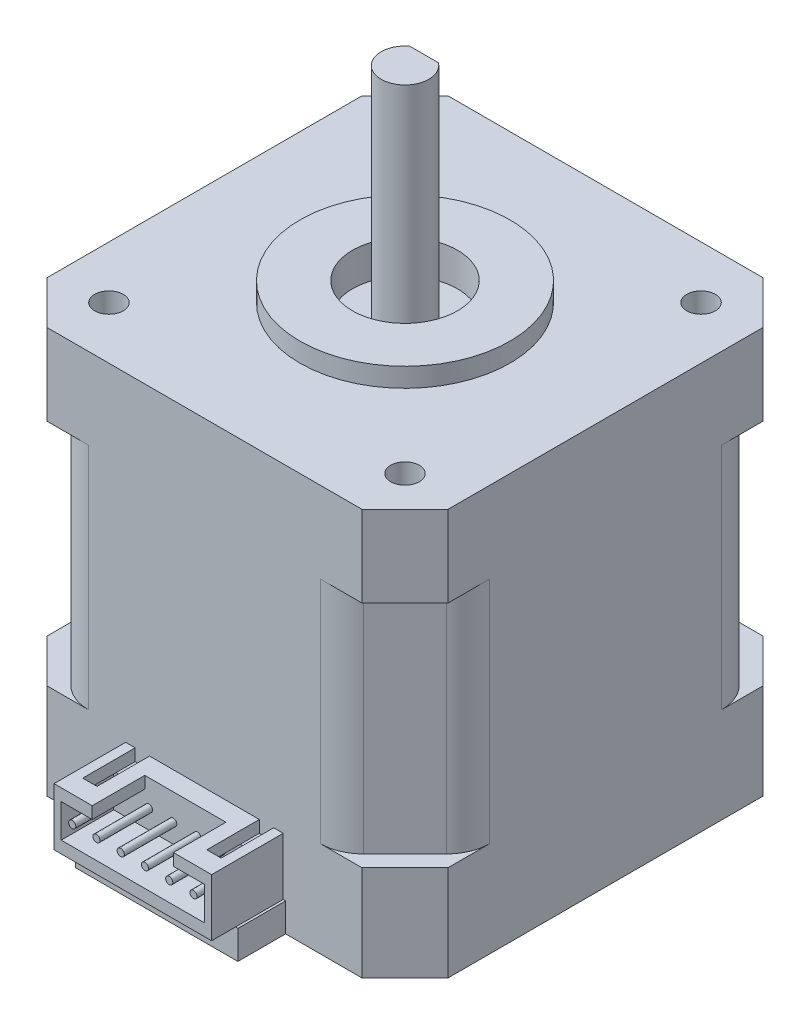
ISO-10303-21;
HEADER;
FILE_DESCRIPTION(('STEP AP214'),'2;1');
FILE_NAME('part.step','',(''),(''),'','','');
FILE_SCHEMA(('AUTOMOTIVE_DESIGN { 1 0 10303 214 1 1 1 1 }'));
ENDSEC;
DATA;
#1=APPLICATION_CONTEXT('core data for automotive mechanical design processes');
#2=APPLICATION_PROTOCOL_DEFINITION('international standard','automotive_design',2000,#1);
#3=PRODUCT_CONTEXT('',#1,'mechanical');
#4=PRODUCT('Part','Part','',(#3));
#5=PRODUCT_RELATED_PRODUCT_CATEGORY('part','',(#4));
#6=PRODUCT_DEFINITION_FORMATION('','',#4);
#7=PRODUCT_DEFINITION_CONTEXT('part definition',#1,'design');
#8=PRODUCT_DEFINITION('design','',#6,#7);
#9=PRODUCT_DEFINITION_SHAPE('','',#8);
#10=(LENGTH_UNIT() NAMED_UNIT(*) SI_UNIT(.MILLI.,.METRE.));
#11=(NAMED_UNIT(*) PLANE_ANGLE_UNIT() SI_UNIT($,.RADIAN.));
#12=(NAMED_UNIT(*) SI_UNIT($,.STERADIAN.) SOLID_ANGLE_UNIT());
#13=UNCERTAINTY_MEASURE_WITH_UNIT(LENGTH_MEASURE(1.E-05),#10,'distance_accuracy_value','');
#14=(GEOMETRIC_REPRESENTATION_CONTEXT(3) GLOBAL_UNCERTAINTY_ASSIGNED_CONTEXT((#13)) GLOBAL_UNIT_ASSIGNED_CONTEXT((#10,
#11,#12)) REPRESENTATION_CONTEXT('',''));
#15=CARTESIAN_POINT('',(0.,0.,0.));
#16=DIRECTION('',(0.,0.,1.));
#17=DIRECTION('',(1.,0.,0.));
#18=AXIS2_PLACEMENT_3D('',#15,#16,#17);
#19=CARTESIAN_POINT('',(-7.5,7.75,23.));
#20=DIRECTION('',(0.,1.,0.));
#21=DIRECTION('',(0.,0.,1.));
#22=AXIS2_PLACEMENT_3D('',#19,#20,#21);
#23=PLANE('',#22);
#24=DIRECTION('',(-1.,0.,0.));
#25=VECTOR('',#24,1.);
#26=CARTESIAN_POINT('',(7.25000000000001,7.75,26.5));
#27=LINE('',#26,#25);
#28=CARTESIAN_POINT('',(7.25000000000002,7.75,26.5));
#29=VERTEX_POINT('',#28);
#30=CARTESIAN_POINT('',(5.75000000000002,7.75,26.5));
#31=VERTEX_POINT('',#30);
#32=EDGE_CURVE('E456',#29,#31,#27,.T.);
#33=ORIENTED_EDGE('',*,*,#32,.F.);
#34=DIRECTION('',(0.,0.,1.));
#35=VECTOR('',#34,1.);
#36=CARTESIAN_POINT('',(7.25000000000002,7.75,21.));
#37=LINE('',#36,#35);
#38=CARTESIAN_POINT('',(7.25000000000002,7.75,23.));
#39=VERTEX_POINT('',#38);
#40=EDGE_CURVE('E459',#39,#29,#37,.T.);
#41=ORIENTED_EDGE('',*,*,#40,.F.);
#42=DIRECTION('',(-1.,0.,0.));
#43=VECTOR('',#42,1.);
#44=CARTESIAN_POINT('',(-7.5,7.75,23.));
#45=LINE('',#44,#43);
#46=CARTESIAN_POINT('',(7.5,7.75,23.));
#47=VERTEX_POINT('',#46);
#48=EDGE_CURVE('E507',#47,#39,#45,.T.);
#49=ORIENTED_EDGE('',*,*,#48,.F.);
#50=DIRECTION('',(0.,0.,1.));
#51=VECTOR('',#50,1.);
#52=CARTESIAN_POINT('',(7.5,7.75,23.));
#53=LINE('',#52,#51);
#54=CARTESIAN_POINT('',(7.5,7.75,28.5));
#55=VERTEX_POINT('',#54);
#56=EDGE_CURVE('E518',#47,#55,#53,.T.);
#57=ORIENTED_EDGE('',*,*,#56,.T.);
#58=DIRECTION('',(-1.,0.,0.));
#59=VECTOR('',#58,1.);
#60=CARTESIAN_POINT('',(-7.5,7.75,28.5));
#61=LINE('',#60,#59);
#62=CARTESIAN_POINT('',(4.25,7.75,28.5));
#63=VERTEX_POINT('',#62);
#64=EDGE_CURVE('E521',#55,#63,#61,.T.);
#65=ORIENTED_EDGE('',*,*,#64,.T.);
#66=DIRECTION('',(0.,0.,1.));
#67=VECTOR('',#66,1.);
#68=CARTESIAN_POINT('',(4.25,7.75,28.5));
#69=LINE('',#68,#67);
#70=CARTESIAN_POINT('',(4.25,7.75,23.));
#71=VERTEX_POINT('',#70);
#72=EDGE_CURVE('E490',#71,#63,#69,.T.);
#73=ORIENTED_EDGE('',*,*,#72,.F.);
#74=CARTESIAN_POINT('',(5.75000000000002,7.75,23.));
#75=VERTEX_POINT('',#74);
#76=EDGE_CURVE('E992',#75,#71,#45,.T.);
#77=ORIENTED_EDGE('',*,*,#76,.F.);
#78=DIRECTION('',(0.,0.,-1.));
#79=VECTOR('',#78,1.);
#80=CARTESIAN_POINT('',(5.75000000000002,7.75,21.));
#81=LINE('',#80,#79);
#82=EDGE_CURVE('E454',#31,#75,#81,.T.);
#83=ORIENTED_EDGE('',*,*,#82,.F.);
#84=EDGE_LOOP('',(#33,#41,#49,#57,#65,#73,#77,#83));
#85=FACE_BOUND('',#84,.T.);
#86=ADVANCED_FACE('F34',(#85),#23,.F.);
#87=CARTESIAN_POINT('',(-16.5,10.,21.));
#88=DIRECTION('',(0.,0.,-1.));
#89=DIRECTION('',(-1.,0.,0.));
#90=AXIS2_PLACEMENT_3D('',#87,#88,#89);
#91=PLANE('',#90);
#92=DIRECTION('',(0.,-1.,0.));
#93=VECTOR('',#92,1.);
#94=CARTESIAN_POINT('',(-8.25,3.,21.));
#95=LINE('',#94,#93);
#96=CARTESIAN_POINT('',(-8.25,9.,21.));
#97=VERTEX_POINT('',#96);
#98=CARTESIAN_POINT('',(-8.25,3.,21.));
#99=VERTEX_POINT('',#98);
#100=EDGE_CURVE('E531',#97,#99,#95,.T.);
#101=ORIENTED_EDGE('',*,*,#100,.F.);
#102=DIRECTION('',(-1.,0.,0.));
#103=VECTOR('',#102,1.);
#104=CARTESIAN_POINT('',(-8.25,9.,21.));
#105=LINE('',#104,#103);
#106=CARTESIAN_POINT('',(-7.25,8.99999999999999,21.));
#107=VERTEX_POINT('',#106);
#108=EDGE_CURVE('E555',#107,#97,#105,.T.);
#109=ORIENTED_EDGE('',*,*,#108,.F.);
#110=DIRECTION('',(0.,1.,0.));
#111=VECTOR('',#110,1.);
#112=CARTESIAN_POINT('',(-7.25,2.04912287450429,21.));
#113=LINE('',#112,#111);
#114=CARTESIAN_POINT('',(-7.25,7.75,21.));
#115=VERTEX_POINT('',#114);
#116=EDGE_CURVE('E447',#115,#107,#113,.T.);
#117=ORIENTED_EDGE('',*,*,#116,.F.);
#118=DIRECTION('',(1.,0.,0.));
#119=VECTOR('',#118,1.);
#120=CARTESIAN_POINT('',(-7.25,7.75,21.));
#121=LINE('',#120,#119);
#122=CARTESIAN_POINT('',(-5.75000000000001,7.75,21.));
#123=VERTEX_POINT('',#122);
#124=EDGE_CURVE('E1239',#115,#123,#121,.T.);
#125=ORIENTED_EDGE('',*,*,#124,.T.);
#126=DIRECTION('',(0.,1.,0.));
#127=VECTOR('',#126,1.);
#128=CARTESIAN_POINT('',(-5.75000000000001,2.04912287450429,21.));
#129=LINE('',#128,#127);
#130=CARTESIAN_POINT('',(-5.75000000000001,8.99999999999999,21.));
#131=VERTEX_POINT('',#130);
#132=EDGE_CURVE('E431',#123,#131,#129,.T.);
#133=ORIENTED_EDGE('',*,*,#132,.T.);
#134=CARTESIAN_POINT('',(5.75000000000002,8.99999999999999,21.));
#135=VERTEX_POINT('',#134);
#136=EDGE_CURVE('E442',#135,#131,#105,.T.);
#137=ORIENTED_EDGE('',*,*,#136,.F.);
#138=DIRECTION('',(0.,1.,0.));
#139=VECTOR('',#138,1.);
#140=CARTESIAN_POINT('',(5.75000000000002,2.04912287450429,21.));
#141=LINE('',#140,#139);
#142=CARTESIAN_POINT('',(5.75000000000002,7.75,21.));
#143=VERTEX_POINT('',#142);
#144=EDGE_CURVE('E477',#143,#135,#141,.T.);
#145=ORIENTED_EDGE('',*,*,#144,.F.);
#146=DIRECTION('',(1.,0.,0.));
#147=VECTOR('',#146,1.);
#148=CARTESIAN_POINT('',(7.25000000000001,7.75,21.));
#149=LINE('',#148,#147);
#150=CARTESIAN_POINT('',(7.25000000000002,7.75,21.));
#151=VERTEX_POINT('',#150);
#152=EDGE_CURVE('E463',#143,#151,#149,.T.);
#153=ORIENTED_EDGE('',*,*,#152,.T.);
#154=DIRECTION('',(0.,1.,0.));
#155=VECTOR('',#154,1.);
#156=CARTESIAN_POINT('',(7.25000000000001,2.04912287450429,21.));
#157=LINE('',#156,#155);
#158=CARTESIAN_POINT('',(7.25000000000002,8.99999999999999,21.));
#159=VERTEX_POINT('',#158);
#160=EDGE_CURVE('E472',#151,#159,#157,.T.);
#161=ORIENTED_EDGE('',*,*,#160,.T.);
#162=CARTESIAN_POINT('',(8.25,8.99999999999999,21.));
#163=VERTEX_POINT('',#162);
#164=EDGE_CURVE('E543',#163,#159,#105,.T.);
#165=ORIENTED_EDGE('',*,*,#164,.F.);
#166=DIRECTION('',(0.,1.,0.));
#167=VECTOR('',#166,1.);
#168=CARTESIAN_POINT('',(8.25,3.,21.));
#169=LINE('',#168,#167);
#170=CARTESIAN_POINT('',(8.25,3.,21.));
#171=VERTEX_POINT('',#170);
#172=EDGE_CURVE('E553',#171,#163,#169,.T.);
#173=ORIENTED_EDGE('',*,*,#172,.F.);
#174=DIRECTION('',(-1.,0.,0.));
#175=VECTOR('',#174,1.);
#176=CARTESIAN_POINT('',(8.5,3.,21.));
#177=LINE('',#176,#175);
#178=CARTESIAN_POINT('',(8.5,3.,21.));
#179=VERTEX_POINT('',#178);
#180=EDGE_CURVE('E583',#179,#171,#177,.T.);
#181=ORIENTED_EDGE('',*,*,#180,.F.);
#182=DIRECTION('',(0.,1.,0.));
#183=VECTOR('',#182,1.);
#184=CARTESIAN_POINT('',(8.5,3.,21.));
#185=LINE('',#184,#183);
#186=CARTESIAN_POINT('',(8.5,0.,21.));
#187=VERTEX_POINT('',#186);
#188=EDGE_CURVE('E589',#187,#179,#185,.T.);
#189=ORIENTED_EDGE('',*,*,#188,.F.);
#190=DIRECTION('',(1.,0.,0.));
#191=VECTOR('',#190,1.);
#192=CARTESIAN_POINT('',(-16.5,0.,21.));
#193=LINE('',#192,#191);
#194=CARTESIAN_POINT('',(16.5,0.,21.));
#195=VERTEX_POINT('',#194);
#196=EDGE_CURVE('E885',#187,#195,#193,.T.);
#197=ORIENTED_EDGE('',*,*,#196,.T.);
#198=DIRECTION('',(0.,-1.,0.));
#199=VECTOR('',#198,1.);
#200=CARTESIAN_POINT('',(16.5,10.,21.));
#201=LINE('',#200,#199);
#202=CARTESIAN_POINT('',(16.5,10.,21.));
#203=VERTEX_POINT('',#202);
#204=EDGE_CURVE('E912',#203,#195,#201,.T.);
#205=ORIENTED_EDGE('',*,*,#204,.F.);
#206=DIRECTION('',(1.,0.,0.));
#207=VECTOR('',#206,1.);
#208=CARTESIAN_POINT('',(-16.5,10.,21.));
#209=LINE('',#208,#207);
#210=CARTESIAN_POINT('',(12.1360389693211,10.,21.));
#211=VERTEX_POINT('',#210);
#212=EDGE_CURVE('E865',#211,#203,#209,.T.);
#213=ORIENTED_EDGE('',*,*,#212,.F.);
#214=DIRECTION('',(0.,-1.,0.));
#215=VECTOR('',#214,1.);
#216=CARTESIAN_POINT('',(12.1360389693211,34.,21.));
#217=LINE('',#216,#215);
#218=CARTESIAN_POINT('',(12.1360389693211,34.,21.));
#219=VERTEX_POINT('',#218);
#220=EDGE_CURVE('E847',#219,#211,#217,.T.);
#221=ORIENTED_EDGE('',*,*,#220,.F.);
#222=DIRECTION('',(1.,0.,0.));
#223=VECTOR('',#222,1.);
#224=CARTESIAN_POINT('',(16.5,34.,21.));
#225=LINE('',#224,#223);
#226=CARTESIAN_POINT('',(16.5,34.,21.));
#227=VERTEX_POINT('',#226);
#228=EDGE_CURVE('E705',#219,#227,#225,.T.);
#229=ORIENTED_EDGE('',*,*,#228,.T.);
#230=DIRECTION('',(0.,-1.,0.));
#231=VECTOR('',#230,1.);
#232=CARTESIAN_POINT('',(16.5,42.5,21.));
#233=LINE('',#232,#231);
#234=CARTESIAN_POINT('',(16.5,42.5,21.));
#235=VERTEX_POINT('',#234);
#236=EDGE_CURVE('E724',#235,#227,#233,.T.);
#237=ORIENTED_EDGE('',*,*,#236,.F.);
#238=DIRECTION('',(1.,0.,0.));
#239=VECTOR('',#238,1.);
#240=CARTESIAN_POINT('',(16.5,42.5,21.));
#241=LINE('',#240,#239);
#242=CARTESIAN_POINT('',(-16.5,42.5,21.));
#243=VERTEX_POINT('',#242);
#244=EDGE_CURVE('E685',#243,#235,#241,.T.);
#245=ORIENTED_EDGE('',*,*,#244,.F.);
#246=DIRECTION('',(0.,-1.,0.));
#247=VECTOR('',#246,1.);
#248=CARTESIAN_POINT('',(-16.5,42.5,21.));
#249=LINE('',#248,#247);
#250=CARTESIAN_POINT('',(-16.5,34.,21.));
#251=VERTEX_POINT('',#250);
#252=EDGE_CURVE('E727',#243,#251,#249,.T.);
#253=ORIENTED_EDGE('',*,*,#252,.T.);
#254=CARTESIAN_POINT('',(-12.1360389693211,34.,21.));
#255=VERTEX_POINT('',#254);
#256=EDGE_CURVE('E706',#251,#255,#225,.T.);
#257=ORIENTED_EDGE('',*,*,#256,.T.);
#258=DIRECTION('',(0.,-1.,0.));
#259=VECTOR('',#258,1.);
#260=CARTESIAN_POINT('',(-12.1360389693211,34.,21.));
#261=LINE('',#260,#259);
#262=CARTESIAN_POINT('',(-12.1360389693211,10.,21.));
#263=VERTEX_POINT('',#262);
#264=EDGE_CURVE('E850',#255,#263,#261,.T.);
#265=ORIENTED_EDGE('',*,*,#264,.T.);
#266=CARTESIAN_POINT('',(-16.5,10.,21.));
#267=VERTEX_POINT('',#266);
#268=EDGE_CURVE('E866',#267,#263,#209,.T.);
#269=ORIENTED_EDGE('',*,*,#268,.F.);
#270=DIRECTION('',(0.,-1.,0.));
#271=VECTOR('',#270,1.);
#272=CARTESIAN_POINT('',(-16.5,10.,21.));
#273=LINE('',#272,#271);
#274=CARTESIAN_POINT('',(-16.5,0.,21.));
#275=VERTEX_POINT('',#274);
#276=EDGE_CURVE('E915',#267,#275,#273,.T.);
#277=ORIENTED_EDGE('',*,*,#276,.T.);
#278=CARTESIAN_POINT('',(-8.5,0.,21.));
#279=VERTEX_POINT('',#278);
#280=EDGE_CURVE('E886',#275,#279,#193,.T.);
#281=ORIENTED_EDGE('',*,*,#280,.T.);
#282=DIRECTION('',(0.,-1.,0.));
#283=VECTOR('',#282,1.);
#284=CARTESIAN_POINT('',(-8.5,3.,21.));
#285=LINE('',#284,#283);
#286=CARTESIAN_POINT('',(-8.5,3.,21.));
#287=VERTEX_POINT('',#286);
#288=EDGE_CURVE('E586',#287,#279,#285,.T.);
#289=ORIENTED_EDGE('',*,*,#288,.F.);
#290=EDGE_CURVE('E570',#99,#287,#177,.T.);
#291=ORIENTED_EDGE('',*,*,#290,.F.);
#292=EDGE_LOOP('',(#101,#109,#117,#125,#133,#137,#145,#153,#161,#165,#173,#181,#189,#197,#205,
#213,#221,#229,#237,#245,#253,#257,#265,#269,#277,#281,#289,#291));
#293=FACE_BOUND('',#292,.T.);
#294=ADVANCED_FACE('F985',(#293),#91,.F.);
#295=CARTESIAN_POINT('',(8.5,3.,26.));
#296=DIRECTION('',(0.,-1.,0.));
#297=DIRECTION('',(1.,0.,0.));
#298=AXIS2_PLACEMENT_3D('',#295,#296,#297);
#299=PLANE('',#298);
#300=DIRECTION('',(0.,0.,-1.));
#301=VECTOR('',#300,1.);
#302=CARTESIAN_POINT('',(-8.25,3.,28.5));
#303=LINE('',#302,#301);
#304=CARTESIAN_POINT('',(-8.25,3.,26.));
#305=VERTEX_POINT('',#304);
#306=EDGE_CURVE('E567',#305,#99,#303,.T.);
#307=ORIENTED_EDGE('',*,*,#306,.T.);
#308=ORIENTED_EDGE('',*,*,#290,.T.);
#309=DIRECTION('',(0.,0.,-1.));
#310=VECTOR('',#309,1.);
#311=CARTESIAN_POINT('',(-8.5,3.,26.));
#312=LINE('',#311,#310);
#313=CARTESIAN_POINT('',(-8.5,3.,26.));
#314=VERTEX_POINT('',#313);
#315=EDGE_CURVE('E600',#314,#287,#312,.T.);
#316=ORIENTED_EDGE('',*,*,#315,.F.);
#317=DIRECTION('',(-1.,0.,0.));
#318=VECTOR('',#317,1.);
#319=CARTESIAN_POINT('',(8.5,3.,26.));
#320=LINE('',#319,#318);
#321=EDGE_CURVE('E576',#305,#314,#320,.T.);
#322=ORIENTED_EDGE('',*,*,#321,.F.);
#323=EDGE_LOOP('',(#307,#308,#316,#322));
#324=FACE_BOUND('',#323,.T.);
#325=ADVANCED_FACE('F1132',(#324),#299,.F.);
#326=DIRECTION('',(0.,0.,-1.));
#327=VECTOR('',#326,1.);
#328=CARTESIAN_POINT('',(8.25,3.,28.5));
#329=LINE('',#328,#327);
#330=CARTESIAN_POINT('',(8.25,3.,26.));
#331=VERTEX_POINT('',#330);
#332=EDGE_CURVE('E563',#331,#171,#329,.T.);
#333=ORIENTED_EDGE('',*,*,#332,.F.);
#334=CARTESIAN_POINT('',(8.5,3.,26.));
#335=VERTEX_POINT('',#334);
#336=EDGE_CURVE('E571',#335,#331,#320,.T.);
#337=ORIENTED_EDGE('',*,*,#336,.F.);
#338=DIRECTION('',(0.,0.,-1.));
#339=VECTOR('',#338,1.);
#340=CARTESIAN_POINT('',(8.5,3.,26.));
#341=LINE('',#340,#339);
#342=EDGE_CURVE('E582',#335,#179,#341,.T.);
#343=ORIENTED_EDGE('',*,*,#342,.T.);
#344=ORIENTED_EDGE('',*,*,#180,.T.);
#345=EDGE_LOOP('',(#333,#337,#343,#344));
#346=FACE_BOUND('',#345,.T.);
#347=ADVANCED_FACE('F1042',(#346),#299,.F.);
#348=CARTESIAN_POINT('',(-15.5,-0.001000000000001,-15.5));
#349=DIRECTION('',(0.,1.,0.));
#350=DIRECTION('',(0.,0.,1.));
#351=AXIS2_PLACEMENT_3D('',#348,#349,#350);
#352=CYLINDRICAL_SURFACE('',#351,1.5);
#353=CARTESIAN_POINT('',(-15.5,42.5,-15.5));
#354=DIRECTION('',(0.,1.,0.));
#355=DIRECTION('',(0.,0.,1.));
#356=AXIS2_PLACEMENT_3D('',#353,#354,#355);
#357=CIRCLE('',#356,1.5);
#358=CARTESIAN_POINT('',(-15.5,42.5,-14.));
#359=VERTEX_POINT('',#358);
#360=EDGE_CURVE('E658',#359,#359,#357,.T.);
#361=ORIENTED_EDGE('',*,*,#360,.T.);
#362=EDGE_LOOP('',(#361));
#363=FACE_BOUND('',#362,.T.);
#364=CARTESIAN_POINT('',(-15.5,3.,-15.5));
#365=DIRECTION('',(0.,-1.,0.));
#366=DIRECTION('',(0.,0.,-1.));
#367=AXIS2_PLACEMENT_3D('',#364,#365,#366);
#368=CIRCLE('',#367,1.5);
#369=CARTESIAN_POINT('',(-15.5,3.,-17.));
#370=VERTEX_POINT('',#369);
#371=EDGE_CURVE('E637',#370,#370,#368,.F.);
#372=ORIENTED_EDGE('',*,*,#371,.F.);
#373=EDGE_LOOP('',(#372));
#374=FACE_BOUND('',#373,.T.);
#375=ADVANCED_FACE('F1455',(#363,#374),#352,.F.);
#376=CARTESIAN_POINT('',(15.5,-0.001000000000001,-15.5000000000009));
#377=DIRECTION('',(0.,1.,0.));
#378=DIRECTION('',(0.,0.,1.));
#379=AXIS2_PLACEMENT_3D('',#376,#377,#378);
#380=CYLINDRICAL_SURFACE('',#379,1.5000000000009);
#381=CARTESIAN_POINT('',(15.5,42.5,-15.5000000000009));
#382=DIRECTION('',(0.,1.,0.));
#383=DIRECTION('',(0.,0.,1.));
#384=AXIS2_PLACEMENT_3D('',#381,#382,#383);
#385=CIRCLE('',#384,1.5000000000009);
#386=CARTESIAN_POINT('',(15.5,42.5,-14.));
#387=VERTEX_POINT('',#386);
#388=EDGE_CURVE('E655',#387,#387,#385,.T.);
#389=ORIENTED_EDGE('',*,*,#388,.T.);
#390=EDGE_LOOP('',(#389));
#391=FACE_BOUND('',#390,.T.);
#392=CARTESIAN_POINT('',(15.5,3.,-15.5000000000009));
#393=DIRECTION('',(0.,-1.,0.));
#394=DIRECTION('',(0.,0.,-1.));
#395=AXIS2_PLACEMENT_3D('',#392,#393,#394);
#396=CIRCLE('',#395,1.5000000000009);
#397=CARTESIAN_POINT('',(15.5,3.,-17.0000000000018));
#398=VERTEX_POINT('',#397);
#399=EDGE_CURVE('E925',#398,#398,#396,.F.);
#400=ORIENTED_EDGE('',*,*,#399,.F.);
#401=EDGE_LOOP('',(#400));
#402=FACE_BOUND('',#401,.T.);
#403=ADVANCED_FACE('F1747',(#391,#402),#380,.F.);
#404=CARTESIAN_POINT('',(15.5000000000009,-0.001000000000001,15.4999999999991));
#405=DIRECTION('',(0.,1.,0.));
#406=DIRECTION('',(0.,0.,1.));
#407=AXIS2_PLACEMENT_3D('',#404,#405,#406);
#408=CYLINDRICAL_SURFACE('',#407,1.50000000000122);
#409=CARTESIAN_POINT('',(15.5000000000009,42.5,15.4999999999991));
#410=DIRECTION('',(0.,1.,0.));
#411=DIRECTION('',(0.,0.,1.));
#412=AXIS2_PLACEMENT_3D('',#409,#410,#411);
#413=CIRCLE('',#412,1.50000000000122);
#414=CARTESIAN_POINT('',(15.5000000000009,42.5,17.0000000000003));
#415=VERTEX_POINT('',#414);
#416=EDGE_CURVE('E659',#415,#415,#413,.T.);
#417=ORIENTED_EDGE('',*,*,#416,.T.);
#418=EDGE_LOOP('',(#417));
#419=FACE_BOUND('',#418,.T.);
#420=CARTESIAN_POINT('',(15.5000000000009,3.,15.4999999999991));
#421=DIRECTION('',(0.,-1.,0.));
#422=DIRECTION('',(0.,0.,-1.));
#423=AXIS2_PLACEMENT_3D('',#420,#421,#422);
#424=CIRCLE('',#423,1.50000000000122);
#425=CARTESIAN_POINT('',(15.5000000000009,3.,13.9999999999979));
#426=VERTEX_POINT('',#425);
#427=EDGE_CURVE('E922',#426,#426,#424,.F.);
#428=ORIENTED_EDGE('',*,*,#427,.F.);
#429=EDGE_LOOP('',(#428));
#430=FACE_BOUND('',#429,.T.);
#431=ADVANCED_FACE('F1750',(#419,#430),#408,.F.);
#432=CARTESIAN_POINT('',(-15.4999999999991,-0.001000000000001,15.5));
#433=DIRECTION('',(0.,1.,0.));
#434=DIRECTION('',(0.,0.,1.));
#435=AXIS2_PLACEMENT_3D('',#432,#433,#434);
#436=CYLINDRICAL_SURFACE('',#435,1.50000000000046);
#437=CARTESIAN_POINT('',(-15.4999999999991,42.5,15.5));
#438=DIRECTION('',(0.,1.,0.));
#439=DIRECTION('',(0.,0.,1.));
#440=AXIS2_PLACEMENT_3D('',#437,#438,#439);
#441=CIRCLE('',#440,1.50000000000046);
#442=CARTESIAN_POINT('',(-15.4999999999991,42.5,17.0000000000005));
#443=VERTEX_POINT('',#442);
#444=EDGE_CURVE('E652',#443,#443,#441,.T.);
#445=ORIENTED_EDGE('',*,*,#444,.T.);
#446=EDGE_LOOP('',(#445));
#447=FACE_BOUND('',#446,.T.);
#448=CARTESIAN_POINT('',(-15.4999999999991,3.,15.5));
#449=DIRECTION('',(0.,-1.,0.));
#450=DIRECTION('',(0.,0.,-1.));
#451=AXIS2_PLACEMENT_3D('',#448,#449,#450);
#452=CIRCLE('',#451,1.50000000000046);
#453=CARTESIAN_POINT('',(-15.4999999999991,3.,13.9999999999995));
#454=VERTEX_POINT('',#453);
#455=EDGE_CURVE('E625',#454,#454,#452,.F.);
#456=ORIENTED_EDGE('',*,*,#455,.F.);
#457=EDGE_LOOP('',(#456));
#458=FACE_BOUND('',#457,.T.);
#459=ADVANCED_FACE('F1312',(#447,#458),#436,.F.);
#460=CARTESIAN_POINT('',(0.,10.,0.));
#461=DIRECTION('',(0.,-1.,0.));
#462=DIRECTION('',(0.,0.,-1.));
#463=AXIS2_PLACEMENT_3D('',#460,#461,#462);
#464=PLANE('',#463);
#465=CARTESIAN_POINT('',(-16.5,10.,-12.1360389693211));
#466=DIRECTION('',(0.,1.,0.));
#467=DIRECTION('',(0.,0.,1.));
#468=AXIS2_PLACEMENT_3D('',#465,#466,#467);
#469=CIRCLE('',#468,4.5);
#470=CARTESIAN_POINT('',(-19.6819805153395,10.,-15.3180194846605));
#471=VERTEX_POINT('',#470);
#472=CARTESIAN_POINT('',(-21.,10.,-12.1360389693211));
#473=VERTEX_POINT('',#472);
#474=EDGE_CURVE('E744',#471,#473,#469,.T.);
#475=ORIENTED_EDGE('',*,*,#474,.F.);
#476=DIRECTION('',(-0.707106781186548,0.,0.707106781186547));
#477=VECTOR('',#476,1.);
#478=CARTESIAN_POINT('',(-15.3180194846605,10.,-19.6819805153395));
#479=LINE('',#478,#477);
#480=CARTESIAN_POINT('',(-15.3180194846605,10.,-19.6819805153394));
#481=VERTEX_POINT('',#480);
#482=EDGE_CURVE('E807',#481,#471,#479,.T.);
#483=ORIENTED_EDGE('',*,*,#482,.F.);
#484=CARTESIAN_POINT('',(-12.1360389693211,10.,-16.5));
#485=DIRECTION('',(0.,1.,0.));
#486=DIRECTION('',(0.,0.,-1.));
#487=AXIS2_PLACEMENT_3D('',#484,#485,#486);
#488=CIRCLE('',#487,4.5);
#489=CARTESIAN_POINT('',(-12.1360389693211,10.,-21.));
#490=VERTEX_POINT('',#489);
#491=EDGE_CURVE('E804',#490,#481,#488,.T.);
#492=ORIENTED_EDGE('',*,*,#491,.F.);
#493=DIRECTION('',(-1.,0.,0.));
#494=VECTOR('',#493,1.);
#495=CARTESIAN_POINT('',(-16.5,10.,-21.));
#496=LINE('',#495,#494);
#497=CARTESIAN_POINT('',(-16.5,10.,-21.));
#498=VERTEX_POINT('',#497);
#499=EDGE_CURVE('E875',#490,#498,#496,.T.);
#500=ORIENTED_EDGE('',*,*,#499,.T.);
#501=DIRECTION('',(-0.707106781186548,0.,0.707106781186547));
#502=VECTOR('',#501,1.);
#503=CARTESIAN_POINT('',(-21.,10.,-16.5));
#504=LINE('',#503,#502);
#505=CARTESIAN_POINT('',(-21.,10.,-16.5));
#506=VERTEX_POINT('',#505);
#507=EDGE_CURVE('E878',#498,#506,#504,.T.);
#508=ORIENTED_EDGE('',*,*,#507,.T.);
#509=DIRECTION('',(0.,0.,1.));
#510=VECTOR('',#509,1.);
#511=CARTESIAN_POINT('',(-21.,10.,16.5));
#512=LINE('',#511,#510);
#513=EDGE_CURVE('E860',#506,#473,#512,.T.);
#514=ORIENTED_EDGE('',*,*,#513,.T.);
#515=EDGE_LOOP('',(#475,#483,#492,#500,#508,#514));
#516=FACE_BOUND('',#515,.T.);
#517=ADVANCED_FACE('F1309',(#516),#464,.F.);
#518=CARTESIAN_POINT('',(12.1360389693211,10.,-16.5));
#519=DIRECTION('',(0.,1.,0.));
#520=DIRECTION('',(0.,0.,1.));
#521=AXIS2_PLACEMENT_3D('',#518,#519,#520);
#522=CIRCLE('',#521,4.5);
#523=CARTESIAN_POINT('',(15.3180194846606,10.,-19.6819805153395));
#524=VERTEX_POINT('',#523);
#525=CARTESIAN_POINT('',(12.1360389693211,10.,-21.));
#526=VERTEX_POINT('',#525);
#527=EDGE_CURVE('E801',#524,#526,#522,.T.);
#528=ORIENTED_EDGE('',*,*,#527,.F.);
#529=DIRECTION('',(-0.707106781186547,0.,-0.707106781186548));
#530=VECTOR('',#529,1.);
#531=CARTESIAN_POINT('',(19.6819805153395,10.,-15.3180194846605));
#532=LINE('',#531,#530);
#533=CARTESIAN_POINT('',(19.6819805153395,10.,-15.3180194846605));
#534=VERTEX_POINT('',#533);
#535=EDGE_CURVE('E798',#534,#524,#532,.T.);
#536=ORIENTED_EDGE('',*,*,#535,.F.);
#537=CARTESIAN_POINT('',(16.5,10.,-12.1360389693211));
#538=DIRECTION('',(0.,1.,0.));
#539=DIRECTION('',(0.,0.,-1.));
#540=AXIS2_PLACEMENT_3D('',#537,#538,#539);
#541=CIRCLE('',#540,4.5);
#542=CARTESIAN_POINT('',(21.,10.,-12.1360389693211));
#543=VERTEX_POINT('',#542);
#544=EDGE_CURVE('E795',#543,#534,#541,.T.);
#545=ORIENTED_EDGE('',*,*,#544,.F.);
#546=DIRECTION('',(0.,0.,-1.));
#547=VECTOR('',#546,1.);
#548=CARTESIAN_POINT('',(21.,10.,16.5));
#549=LINE('',#548,#547);
#550=CARTESIAN_POINT('',(21.,10.,-16.5));
#551=VERTEX_POINT('',#550);
#552=EDGE_CURVE('E870',#543,#551,#549,.T.);
#553=ORIENTED_EDGE('',*,*,#552,.T.);
#554=DIRECTION('',(-0.707106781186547,0.,-0.707106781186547));
#555=VECTOR('',#554,1.);
#556=CARTESIAN_POINT('',(16.5,10.,-21.));
#557=LINE('',#556,#555);
#558=CARTESIAN_POINT('',(16.5,10.,-21.));
#559=VERTEX_POINT('',#558);
#560=EDGE_CURVE('E873',#551,#559,#557,.T.);
#561=ORIENTED_EDGE('',*,*,#560,.T.);
#562=EDGE_CURVE('E876',#559,#526,#496,.T.);
#563=ORIENTED_EDGE('',*,*,#562,.T.);
#564=EDGE_LOOP('',(#528,#536,#545,#553,#561,#563));
#565=FACE_BOUND('',#564,.T.);
#566=ADVANCED_FACE('F1076',(#565),#464,.F.);
#567=CARTESIAN_POINT('',(16.5,10.,12.1360389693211));
#568=DIRECTION('',(0.,1.,0.));
#569=DIRECTION('',(0.,0.,1.));
#570=AXIS2_PLACEMENT_3D('',#567,#568,#569);
#571=CIRCLE('',#570,4.5);
#572=CARTESIAN_POINT('',(19.6819805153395,10.,15.3180194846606));
#573=VERTEX_POINT('',#572);
#574=CARTESIAN_POINT('',(21.,10.,12.1360389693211));
#575=VERTEX_POINT('',#574);
#576=EDGE_CURVE('E792',#573,#575,#571,.T.);
#577=ORIENTED_EDGE('',*,*,#576,.F.);
#578=DIRECTION('',(0.707106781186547,0.,-0.707106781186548));
#579=VECTOR('',#578,1.);
#580=CARTESIAN_POINT('',(19.6819805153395,10.,15.3180194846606));
#581=LINE('',#580,#579);
#582=CARTESIAN_POINT('',(15.3180194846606,10.,19.6819805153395));
#583=VERTEX_POINT('',#582);
#584=EDGE_CURVE('E789',#583,#573,#581,.T.);
#585=ORIENTED_EDGE('',*,*,#584,.F.);
#586=CARTESIAN_POINT('',(12.1360389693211,10.,16.5));
#587=DIRECTION('',(0.,1.,0.));
#588=DIRECTION('',(0.,0.,-1.));
#589=AXIS2_PLACEMENT_3D('',#586,#587,#588);
#590=CIRCLE('',#589,4.5);
#591=EDGE_CURVE('E786',#211,#583,#590,.T.);
#592=ORIENTED_EDGE('',*,*,#591,.F.);
#593=ORIENTED_EDGE('',*,*,#212,.T.);
#594=DIRECTION('',(0.707106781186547,0.,-0.707106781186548));
#595=VECTOR('',#594,1.);
#596=CARTESIAN_POINT('',(16.5,10.,21.));
#597=LINE('',#596,#595);
#598=CARTESIAN_POINT('',(21.,10.,16.5));
#599=VERTEX_POINT('',#598);
#600=EDGE_CURVE('E868',#203,#599,#597,.T.);
#601=ORIENTED_EDGE('',*,*,#600,.T.);
#602=EDGE_CURVE('E871',#599,#575,#549,.T.);
#603=ORIENTED_EDGE('',*,*,#602,.T.);
#604=EDGE_LOOP('',(#577,#585,#592,#593,#601,#603));
#605=FACE_BOUND('',#604,.T.);
#606=ADVANCED_FACE('F1109',(#605),#464,.F.);
#607=CARTESIAN_POINT('',(-16.5,10.,12.1360389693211));
#608=DIRECTION('',(0.,1.,0.));
#609=DIRECTION('',(0.,0.,-1.));
#610=AXIS2_PLACEMENT_3D('',#607,#608,#609);
#611=CIRCLE('',#610,4.5);
#612=CARTESIAN_POINT('',(-21.,10.,12.1360389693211));
#613=VERTEX_POINT('',#612);
#614=CARTESIAN_POINT('',(-19.6819805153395,10.,15.3180194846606));
#615=VERTEX_POINT('',#614);
#616=EDGE_CURVE('E739',#613,#615,#611,.T.);
#617=ORIENTED_EDGE('',*,*,#616,.F.);
#618=CARTESIAN_POINT('',(-21.,10.,16.5));
#619=VERTEX_POINT('',#618);
#620=EDGE_CURVE('E863',#613,#619,#512,.T.);
#621=ORIENTED_EDGE('',*,*,#620,.T.);
#622=DIRECTION('',(0.707106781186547,0.,0.707106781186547));
#623=VECTOR('',#622,1.);
#624=CARTESIAN_POINT('',(-21.,10.,16.5));
#625=LINE('',#624,#623);
#626=EDGE_CURVE('E862',#619,#267,#625,.T.);
#627=ORIENTED_EDGE('',*,*,#626,.T.);
#628=ORIENTED_EDGE('',*,*,#268,.T.);
#629=CARTESIAN_POINT('',(-12.1360389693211,10.,16.5));
#630=DIRECTION('',(0.,1.,0.));
#631=DIRECTION('',(0.,0.,1.));
#632=AXIS2_PLACEMENT_3D('',#629,#630,#631);
#633=CIRCLE('',#632,4.5);
#634=CARTESIAN_POINT('',(-15.3180194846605,10.,19.6819805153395));
#635=VERTEX_POINT('',#634);
#636=EDGE_CURVE('E783',#635,#263,#633,.T.);
#637=ORIENTED_EDGE('',*,*,#636,.F.);
#638=DIRECTION('',(0.707106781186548,0.,0.707106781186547));
#639=VECTOR('',#638,1.);
#640=CARTESIAN_POINT('',(-15.3180194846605,10.,19.6819805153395));
#641=LINE('',#640,#639);
#642=EDGE_CURVE('E780',#615,#635,#641,.T.);
#643=ORIENTED_EDGE('',*,*,#642,.F.);
#644=EDGE_LOOP('',(#617,#621,#627,#628,#637,#643));
#645=FACE_BOUND('',#644,.T.);
#646=ADVANCED_FACE('F1314',(#645),#464,.F.);
#647=CARTESIAN_POINT('',(-21.,10.,16.5));
#648=DIRECTION('',(1.,0.,0.));
#649=DIRECTION('',(0.,0.,-1.));
#650=AXIS2_PLACEMENT_3D('',#647,#648,#649);
#651=PLANE('',#650);
#652=DIRECTION('',(0.,0.,1.));
#653=VECTOR('',#652,1.);
#654=CARTESIAN_POINT('',(-21.,0.,16.5));
#655=LINE('',#654,#653);
#656=CARTESIAN_POINT('',(-21.,0.,-16.5));
#657=VERTEX_POINT('',#656);
#658=CARTESIAN_POINT('',(-21.,0.,16.5));
#659=VERTEX_POINT('',#658);
#660=EDGE_CURVE('E859',#657,#659,#655,.T.);
#661=ORIENTED_EDGE('',*,*,#660,.T.);
#662=DIRECTION('',(0.,-1.,0.));
#663=VECTOR('',#662,1.);
#664=CARTESIAN_POINT('',(-21.,10.,16.5));
#665=LINE('',#664,#663);
#666=EDGE_CURVE('E674',#619,#659,#665,.T.);
#667=ORIENTED_EDGE('',*,*,#666,.F.);
#668=ORIENTED_EDGE('',*,*,#620,.F.);
#669=DIRECTION('',(0.,-1.,0.));
#670=VECTOR('',#669,1.);
#671=CARTESIAN_POINT('',(-21.,34.,12.1360389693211));
#672=LINE('',#671,#670);
#673=CARTESIAN_POINT('',(-21.,34.,12.1360389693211));
#674=VERTEX_POINT('',#673);
#675=EDGE_CURVE('E777',#674,#613,#672,.T.);
#676=ORIENTED_EDGE('',*,*,#675,.F.);
#677=DIRECTION('',(0.,0.,1.));
#678=VECTOR('',#677,1.);
#679=CARTESIAN_POINT('',(-21.,34.,16.5));
#680=LINE('',#679,#678);
#681=CARTESIAN_POINT('',(-21.,34.,16.5));
#682=VERTEX_POINT('',#681);
#683=EDGE_CURVE('E699',#674,#682,#680,.T.);
#684=ORIENTED_EDGE('',*,*,#683,.T.);
#685=DIRECTION('',(0.,-1.,0.));
#686=VECTOR('',#685,1.);
#687=CARTESIAN_POINT('',(-21.,42.5,16.5));
#688=LINE('',#687,#686);
#689=CARTESIAN_POINT('',(-21.,42.5,16.5));
#690=VERTEX_POINT('',#689);
#691=EDGE_CURVE('E730',#690,#682,#688,.T.);
#692=ORIENTED_EDGE('',*,*,#691,.F.);
#693=DIRECTION('',(0.,0.,1.));
#694=VECTOR('',#693,1.);
#695=CARTESIAN_POINT('',(-21.,42.5,16.5));
#696=LINE('',#695,#694);
#697=CARTESIAN_POINT('',(-21.,42.5,-16.5));
#698=VERTEX_POINT('',#697);
#699=EDGE_CURVE('E681',#698,#690,#696,.T.);
#700=ORIENTED_EDGE('',*,*,#699,.F.);
#701=DIRECTION('',(0.,-1.,0.));
#702=VECTOR('',#701,1.);
#703=CARTESIAN_POINT('',(-21.,42.5,-16.5));
#704=LINE('',#703,#702);
#705=CARTESIAN_POINT('',(-21.,34.,-16.5));
#706=VERTEX_POINT('',#705);
#707=EDGE_CURVE('E733',#698,#706,#704,.T.);
#708=ORIENTED_EDGE('',*,*,#707,.T.);
#709=CARTESIAN_POINT('',(-21.,34.,-12.1360389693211));
#710=VERTEX_POINT('',#709);
#711=EDGE_CURVE('E700',#706,#710,#680,.T.);
#712=ORIENTED_EDGE('',*,*,#711,.T.);
#713=DIRECTION('',(0.,-1.,0.));
#714=VECTOR('',#713,1.);
#715=CARTESIAN_POINT('',(-21.,34.,-12.1360389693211));
#716=LINE('',#715,#714);
#717=EDGE_CURVE('E814',#710,#473,#716,.T.);
#718=ORIENTED_EDGE('',*,*,#717,.T.);
#719=ORIENTED_EDGE('',*,*,#513,.F.);
#720=DIRECTION('',(0.,-1.,0.));
#721=VECTOR('',#720,1.);
#722=CARTESIAN_POINT('',(-21.,10.,-16.5));
#723=LINE('',#722,#721);
#724=EDGE_CURVE('E880',#506,#657,#723,.T.);
#725=ORIENTED_EDGE('',*,*,#724,.T.);
#726=EDGE_LOOP('',(#661,#667,#668,#676,#684,#692,#700,#708,#712,#718,#719,#725));
#727=FACE_BOUND('',#726,.T.);
#728=ADVANCED_FACE('F36',(#727),#651,.F.);
#729=CARTESIAN_POINT('',(-21.,10.,16.5));
#730=DIRECTION('',(0.707106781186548,0.,-0.707106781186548));
#731=DIRECTION('',(-0.707106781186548,0.,-0.707106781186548));
#732=AXIS2_PLACEMENT_3D('',#729,#730,#731);
#733=PLANE('',#732);
#734=DIRECTION('',(0.707106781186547,0.,0.707106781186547));
#735=VECTOR('',#734,1.);
#736=CARTESIAN_POINT('',(-21.,0.,16.5));
#737=LINE('',#736,#735);
#738=EDGE_CURVE('E883',#659,#275,#737,.T.);
#739=ORIENTED_EDGE('',*,*,#738,.T.);
#740=ORIENTED_EDGE('',*,*,#276,.F.);
#741=ORIENTED_EDGE('',*,*,#626,.F.);
#742=ORIENTED_EDGE('',*,*,#666,.T.);
#743=EDGE_LOOP('',(#739,#740,#741,#742));
#744=FACE_BOUND('',#743,.T.);
#745=ADVANCED_FACE('F1259',(#744),#733,.F.);
#746=CARTESIAN_POINT('',(16.5,10.,21.));
#747=DIRECTION('',(-0.707106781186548,0.,-0.707106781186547));
#748=DIRECTION('',(-0.707106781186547,0.,0.707106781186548));
#749=AXIS2_PLACEMENT_3D('',#746,#747,#748);
#750=PLANE('',#749);
#751=DIRECTION('',(0.707106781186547,0.,-0.707106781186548));
#752=VECTOR('',#751,1.);
#753=CARTESIAN_POINT('',(16.5,0.,21.));
#754=LINE('',#753,#752);
#755=CARTESIAN_POINT('',(21.,0.,16.5));
#756=VERTEX_POINT('',#755);
#757=EDGE_CURVE('E888',#195,#756,#754,.T.);
#758=ORIENTED_EDGE('',*,*,#757,.T.);
#759=DIRECTION('',(0.,-1.,0.));
#760=VECTOR('',#759,1.);
#761=CARTESIAN_POINT('',(21.,10.,16.5));
#762=LINE('',#761,#760);
#763=EDGE_CURVE('E909',#599,#756,#762,.T.);
#764=ORIENTED_EDGE('',*,*,#763,.F.);
#765=ORIENTED_EDGE('',*,*,#600,.F.);
#766=ORIENTED_EDGE('',*,*,#204,.T.);
#767=EDGE_LOOP('',(#758,#764,#765,#766));
#768=FACE_BOUND('',#767,.T.);
#769=ADVANCED_FACE('F1058',(#768),#750,.F.);
#770=CARTESIAN_POINT('',(21.,10.,16.5));
#771=DIRECTION('',(-1.,0.,0.));
#772=DIRECTION('',(0.,0.,1.));
#773=AXIS2_PLACEMENT_3D('',#770,#771,#772);
#774=PLANE('',#773);
#775=DIRECTION('',(0.,0.,-1.));
#776=VECTOR('',#775,1.);
#777=CARTESIAN_POINT('',(21.,0.,16.5));
#778=LINE('',#777,#776);
#779=CARTESIAN_POINT('',(21.,0.,-16.5));
#780=VERTEX_POINT('',#779);
#781=EDGE_CURVE('E890',#756,#780,#778,.T.);
#782=ORIENTED_EDGE('',*,*,#781,.T.);
#783=DIRECTION('',(0.,-1.,0.));
#784=VECTOR('',#783,1.);
#785=CARTESIAN_POINT('',(21.,10.,-16.5));
#786=LINE('',#785,#784);
#787=EDGE_CURVE('E906',#551,#780,#786,.T.);
#788=ORIENTED_EDGE('',*,*,#787,.F.);
#789=ORIENTED_EDGE('',*,*,#552,.F.);
#790=DIRECTION('',(0.,-1.,0.));
#791=VECTOR('',#790,1.);
#792=CARTESIAN_POINT('',(21.,34.,-12.1360389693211));
#793=LINE('',#792,#791);
#794=CARTESIAN_POINT('',(21.,34.,-12.1360389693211));
#795=VERTEX_POINT('',#794);
#796=EDGE_CURVE('E835',#795,#543,#793,.T.);
#797=ORIENTED_EDGE('',*,*,#796,.F.);
#798=DIRECTION('',(0.,0.,-1.));
#799=VECTOR('',#798,1.);
#800=CARTESIAN_POINT('',(21.,34.,16.5));
#801=LINE('',#800,#799);
#802=CARTESIAN_POINT('',(21.,34.,-16.5));
#803=VERTEX_POINT('',#802);
#804=EDGE_CURVE('E711',#795,#803,#801,.T.);
#805=ORIENTED_EDGE('',*,*,#804,.T.);
#806=DIRECTION('',(0.,-1.,0.));
#807=VECTOR('',#806,1.);
#808=CARTESIAN_POINT('',(21.,42.5,-16.5));
#809=LINE('',#808,#807);
#810=CARTESIAN_POINT('',(21.,42.5,-16.5));
#811=VERTEX_POINT('',#810);
#812=EDGE_CURVE('E718',#811,#803,#809,.T.);
#813=ORIENTED_EDGE('',*,*,#812,.F.);
#814=DIRECTION('',(0.,0.,-1.));
#815=VECTOR('',#814,1.);
#816=CARTESIAN_POINT('',(21.,42.5,16.5));
#817=LINE('',#816,#815);
#818=CARTESIAN_POINT('',(21.,42.5,16.5));
#819=VERTEX_POINT('',#818);
#820=EDGE_CURVE('E689',#819,#811,#817,.T.);
#821=ORIENTED_EDGE('',*,*,#820,.F.);
#822=DIRECTION('',(0.,-1.,0.));
#823=VECTOR('',#822,1.);
#824=CARTESIAN_POINT('',(21.,42.5,16.5));
#825=LINE('',#824,#823);
#826=CARTESIAN_POINT('',(21.,34.,16.5));
#827=VERTEX_POINT('',#826);
#828=EDGE_CURVE('E721',#819,#827,#825,.T.);
#829=ORIENTED_EDGE('',*,*,#828,.T.);
#830=CARTESIAN_POINT('',(21.,34.,12.1360389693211));
#831=VERTEX_POINT('',#830);
#832=EDGE_CURVE('E712',#827,#831,#801,.T.);
#833=ORIENTED_EDGE('',*,*,#832,.T.);
#834=DIRECTION('',(0.,-1.,0.));
#835=VECTOR('',#834,1.);
#836=CARTESIAN_POINT('',(21.,34.,12.1360389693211));
#837=LINE('',#836,#835);
#838=EDGE_CURVE('E838',#831,#575,#837,.T.);
#839=ORIENTED_EDGE('',*,*,#838,.T.);
#840=ORIENTED_EDGE('',*,*,#602,.F.);
#841=ORIENTED_EDGE('',*,*,#763,.T.);
#842=EDGE_LOOP('',(#782,#788,#789,#797,#805,#813,#821,#829,#833,#839,#840,#841));
#843=FACE_BOUND('',#842,.T.);
#844=ADVANCED_FACE('F1067',(#843),#774,.F.);
#845=CARTESIAN_POINT('',(16.5,10.,-21.));
#846=DIRECTION('',(-0.707106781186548,0.,0.707106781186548));
#847=DIRECTION('',(0.707106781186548,0.,0.707106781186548));
#848=AXIS2_PLACEMENT_3D('',#845,#846,#847);
#849=PLANE('',#848);
#850=DIRECTION('',(-0.707106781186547,0.,-0.707106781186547));
#851=VECTOR('',#850,1.);
#852=CARTESIAN_POINT('',(16.5,0.,-21.));
#853=LINE('',#852,#851);
#854=CARTESIAN_POINT('',(16.5,0.,-21.));
#855=VERTEX_POINT('',#854);
#856=EDGE_CURVE('E892',#780,#855,#853,.T.);
#857=ORIENTED_EDGE('',*,*,#856,.T.);
#858=DIRECTION('',(0.,-1.,0.));
#859=VECTOR('',#858,1.);
#860=CARTESIAN_POINT('',(16.5,10.,-21.));
#861=LINE('',#860,#859);
#862=EDGE_CURVE('E903',#559,#855,#861,.T.);
#863=ORIENTED_EDGE('',*,*,#862,.F.);
#864=ORIENTED_EDGE('',*,*,#560,.F.);
#865=ORIENTED_EDGE('',*,*,#787,.T.);
#866=EDGE_LOOP('',(#857,#863,#864,#865));
#867=FACE_BOUND('',#866,.T.);
#868=ADVANCED_FACE('F1072',(#867),#849,.F.);
#869=CARTESIAN_POINT('',(-16.5,10.,-21.));
#870=DIRECTION('',(0.,0.,1.));
#871=DIRECTION('',(1.,0.,0.));
#872=AXIS2_PLACEMENT_3D('',#869,#870,#871);
#873=PLANE('',#872);
#874=DIRECTION('',(-1.,0.,0.));
#875=VECTOR('',#874,1.);
#876=CARTESIAN_POINT('',(-16.5,0.,-21.));
#877=LINE('',#876,#875);
#878=CARTESIAN_POINT('',(-16.5,0.,-21.));
#879=VERTEX_POINT('',#878);
#880=EDGE_CURVE('E894',#855,#879,#877,.T.);
#881=ORIENTED_EDGE('',*,*,#880,.T.);
#882=DIRECTION('',(0.,-1.,0.));
#883=VECTOR('',#882,1.);
#884=CARTESIAN_POINT('',(-16.5,10.,-21.));
#885=LINE('',#884,#883);
#886=EDGE_CURVE('E900',#498,#879,#885,.T.);
#887=ORIENTED_EDGE('',*,*,#886,.F.);
#888=ORIENTED_EDGE('',*,*,#499,.F.);
#889=DIRECTION('',(0.,-1.,0.));
#890=VECTOR('',#889,1.);
#891=CARTESIAN_POINT('',(-12.1360389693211,34.,-21.));
#892=LINE('',#891,#890);
#893=CARTESIAN_POINT('',(-12.1360389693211,34.,-21.));
#894=VERTEX_POINT('',#893);
#895=EDGE_CURVE('E823',#894,#490,#892,.T.);
#896=ORIENTED_EDGE('',*,*,#895,.F.);
#897=DIRECTION('',(-1.,0.,0.));
#898=VECTOR('',#897,1.);
#899=CARTESIAN_POINT('',(16.5,34.,-21.));
#900=LINE('',#899,#898);
#901=CARTESIAN_POINT('',(-16.5,34.,-21.));
#902=VERTEX_POINT('',#901);
#903=EDGE_CURVE('E669',#894,#902,#900,.T.);
#904=ORIENTED_EDGE('',*,*,#903,.T.);
#905=DIRECTION('',(0.,-1.,0.));
#906=VECTOR('',#905,1.);
#907=CARTESIAN_POINT('',(-16.5,42.5,-21.));
#908=LINE('',#907,#906);
#909=CARTESIAN_POINT('',(-16.5,42.5,-21.));
#910=VERTEX_POINT('',#909);
#911=EDGE_CURVE('E736',#910,#902,#908,.T.);
#912=ORIENTED_EDGE('',*,*,#911,.F.);
#913=DIRECTION('',(-1.,0.,0.));
#914=VECTOR('',#913,1.);
#915=CARTESIAN_POINT('',(16.5,42.5,-21.));
#916=LINE('',#915,#914);
#917=CARTESIAN_POINT('',(16.5,42.5,-21.));
#918=VERTEX_POINT('',#917);
#919=EDGE_CURVE('E675',#918,#910,#916,.T.);
#920=ORIENTED_EDGE('',*,*,#919,.F.);
#921=DIRECTION('',(0.,-1.,0.));
#922=VECTOR('',#921,1.);
#923=CARTESIAN_POINT('',(16.5,42.5,-21.));
#924=LINE('',#923,#922);
#925=CARTESIAN_POINT('',(16.5,34.,-21.));
#926=VERTEX_POINT('',#925);
#927=EDGE_CURVE('E693',#918,#926,#924,.T.);
#928=ORIENTED_EDGE('',*,*,#927,.T.);
#929=CARTESIAN_POINT('',(12.1360389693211,34.,-21.));
#930=VERTEX_POINT('',#929);
#931=EDGE_CURVE('E694',#926,#930,#900,.T.);
#932=ORIENTED_EDGE('',*,*,#931,.T.);
#933=DIRECTION('',(0.,-1.,0.));
#934=VECTOR('',#933,1.);
#935=CARTESIAN_POINT('',(12.1360389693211,34.,-21.));
#936=LINE('',#935,#934);
#937=EDGE_CURVE('E826',#930,#526,#936,.T.);
#938=ORIENTED_EDGE('',*,*,#937,.T.);
#939=ORIENTED_EDGE('',*,*,#562,.F.);
#940=ORIENTED_EDGE('',*,*,#862,.T.);
#941=EDGE_LOOP('',(#881,#887,#888,#896,#904,#912,#920,#928,#932,#938,#939,#940));
#942=FACE_BOUND('',#941,.T.);
#943=ADVANCED_FACE('F1272',(#942),#873,.F.);
#944=CARTESIAN_POINT('',(-21.,10.,-16.5));
#945=DIRECTION('',(0.707106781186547,0.,0.707106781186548));
#946=DIRECTION('',(0.707106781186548,0.,-0.707106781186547));
#947=AXIS2_PLACEMENT_3D('',#944,#945,#946);
#948=PLANE('',#947);
#949=DIRECTION('',(-0.707106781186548,0.,0.707106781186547));
#950=VECTOR('',#949,1.);
#951=CARTESIAN_POINT('',(-21.,0.,-16.5));
#952=LINE('',#951,#950);
#953=EDGE_CURVE('E896',#879,#657,#952,.T.);
#954=ORIENTED_EDGE('',*,*,#953,.T.);
#955=ORIENTED_EDGE('',*,*,#724,.F.);
#956=ORIENTED_EDGE('',*,*,#507,.F.);
#957=ORIENTED_EDGE('',*,*,#886,.T.);
#958=EDGE_LOOP('',(#954,#955,#956,#957));
#959=FACE_BOUND('',#958,.T.);
#960=ADVANCED_FACE('F1267',(#959),#948,.F.);
#961=CARTESIAN_POINT('',(0.,0.,0.));
#962=DIRECTION('',(0.,-1.,0.));
#963=DIRECTION('',(0.,0.,-1.));
#964=AXIS2_PLACEMENT_3D('',#961,#962,#963);
#965=PLANE('',#964);
#966=CARTESIAN_POINT('',(-15.4999999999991,0.,-15.4999999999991));
#967=DIRECTION('',(0.,-1.,0.));
#968=DIRECTION('',(0.,0.,-1.));
#969=AXIS2_PLACEMENT_3D('',#966,#967,#968);
#970=CIRCLE('',#969,3.50000000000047);
#971=CARTESIAN_POINT('',(-15.4999999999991,0.,-18.9999999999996));
#972=VERTEX_POINT('',#971);
#973=EDGE_CURVE('E603',#972,#972,#970,.T.);
#974=ORIENTED_EDGE('',*,*,#973,.F.);
#975=EDGE_LOOP('',(#974));
#976=FACE_BOUND('',#975,.T.);
#977=CARTESIAN_POINT('',(15.5,0.,-15.4999999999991));
#978=DIRECTION('',(0.,-1.,0.));
#979=DIRECTION('',(0.,0.,-1.));
#980=AXIS2_PLACEMENT_3D('',#977,#978,#979);
#981=CIRCLE('',#980,3.50000000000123);
#982=CARTESIAN_POINT('',(15.5,0.,-19.0000000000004));
#983=VERTEX_POINT('',#982);
#984=EDGE_CURVE('E614',#983,#983,#981,.T.);
#985=ORIENTED_EDGE('',*,*,#984,.F.);
#986=EDGE_LOOP('',(#985));
#987=FACE_BOUND('',#986,.T.);
#988=CARTESIAN_POINT('',(15.5,0.,15.5));
#989=DIRECTION('',(0.,-1.,0.));
#990=DIRECTION('',(0.,0.,-1.));
#991=AXIS2_PLACEMENT_3D('',#988,#989,#990);
#992=CIRCLE('',#991,3.5000000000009);
#993=CARTESIAN_POINT('',(15.5,0.,11.9999999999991));
#994=VERTEX_POINT('',#993);
#995=EDGE_CURVE('E608',#994,#994,#992,.T.);
#996=ORIENTED_EDGE('',*,*,#995,.F.);
#997=EDGE_LOOP('',(#996));
#998=FACE_BOUND('',#997,.T.);
#999=CARTESIAN_POINT('',(-15.4999999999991,0.,15.5));
#1000=DIRECTION('',(0.,-1.,0.));
#1001=DIRECTION('',(0.,0.,-1.));
#1002=AXIS2_PLACEMENT_3D('',#999,#1000,#1001);
#1003=CIRCLE('',#1002,3.5);
#1004=CARTESIAN_POINT('',(-15.4999999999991,0.,12.));
#1005=VERTEX_POINT('',#1004);
#1006=EDGE_CURVE('E607',#1005,#1005,#1003,.T.);
#1007=ORIENTED_EDGE('',*,*,#1006,.F.);
#1008=EDGE_LOOP('',(#1007));
#1009=FACE_BOUND('',#1008,.T.);
#1010=ORIENTED_EDGE('',*,*,#660,.F.);
#1011=ORIENTED_EDGE('',*,*,#953,.F.);
#1012=ORIENTED_EDGE('',*,*,#880,.F.);
#1013=ORIENTED_EDGE('',*,*,#856,.F.);
#1014=ORIENTED_EDGE('',*,*,#781,.F.);
#1015=ORIENTED_EDGE('',*,*,#757,.F.);
#1016=ORIENTED_EDGE('',*,*,#196,.F.);
#1017=DIRECTION('',(0.,0.,-1.));
#1018=VECTOR('',#1017,1.);
#1019=CARTESIAN_POINT('',(8.5,0.,26.));
#1020=LINE('',#1019,#1018);
#1021=CARTESIAN_POINT('',(8.5,0.,26.));
#1022=VERTEX_POINT('',#1021);
#1023=EDGE_CURVE('E594',#1022,#187,#1020,.T.);
#1024=ORIENTED_EDGE('',*,*,#1023,.F.);
#1025=DIRECTION('',(1.,0.,0.));
#1026=VECTOR('',#1025,1.);
#1027=CARTESIAN_POINT('',(8.5,0.,26.));
#1028=LINE('',#1027,#1026);
#1029=CARTESIAN_POINT('',(-8.5,0.,26.));
#1030=VERTEX_POINT('',#1029);
#1031=EDGE_CURVE('E578',#1030,#1022,#1028,.T.);
#1032=ORIENTED_EDGE('',*,*,#1031,.F.);
#1033=DIRECTION('',(0.,0.,-1.));
#1034=VECTOR('',#1033,1.);
#1035=CARTESIAN_POINT('',(-8.5,0.,26.));
#1036=LINE('',#1035,#1034);
#1037=EDGE_CURVE('E597',#1030,#279,#1036,.T.);
#1038=ORIENTED_EDGE('',*,*,#1037,.T.);
#1039=ORIENTED_EDGE('',*,*,#280,.F.);
#1040=ORIENTED_EDGE('',*,*,#738,.F.);
#1041=EDGE_LOOP('',(#1010,#1011,#1012,#1013,#1014,#1015,#1016,#1024,#1032,#1038,#1039,#1040));
#1042=FACE_BOUND('',#1041,.T.);
#1043=ADVANCED_FACE('F1062',(#976,#987,#998,#1009,#1042),#965,.T.);
#1044=CARTESIAN_POINT('',(-16.5,34.,12.1360389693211));
#1045=DIRECTION('',(0.,-1.,0.));
#1046=DIRECTION('',(0.,0.,-1.));
#1047=AXIS2_PLACEMENT_3D('',#1044,#1045,#1046);
#1048=CYLINDRICAL_SURFACE('',#1047,4.5);
#1049=ORIENTED_EDGE('',*,*,#616,.T.);
#1050=DIRECTION('',(0.,-1.,0.));
#1051=VECTOR('',#1050,1.);
#1052=CARTESIAN_POINT('',(-19.6819805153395,34.,15.3180194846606));
#1053=LINE('',#1052,#1051);
#1054=CARTESIAN_POINT('',(-19.6819805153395,34.,15.3180194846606));
#1055=VERTEX_POINT('',#1054);
#1056=EDGE_CURVE('E856',#1055,#615,#1053,.T.);
#1057=ORIENTED_EDGE('',*,*,#1056,.F.);
#1058=CARTESIAN_POINT('',(-16.5,34.,12.1360389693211));
#1059=DIRECTION('',(0.,1.,0.));
#1060=DIRECTION('',(0.,0.,-1.));
#1061=AXIS2_PLACEMENT_3D('',#1058,#1059,#1060);
#1062=CIRCLE('',#1061,4.5);
#1063=EDGE_CURVE('E740',#674,#1055,#1062,.T.);
#1064=ORIENTED_EDGE('',*,*,#1063,.F.);
#1065=ORIENTED_EDGE('',*,*,#675,.T.);
#1066=EDGE_LOOP('',(#1049,#1057,#1064,#1065));
#1067=FACE_BOUND('',#1066,.T.);
#1068=ADVANCED_FACE('F1304',(#1067),#1048,.T.);
#1069=CARTESIAN_POINT('',(-15.3180194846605,34.,19.6819805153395));
#1070=DIRECTION('',(0.707106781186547,0.,-0.707106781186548));
#1071=DIRECTION('',(-0.707106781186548,0.,-0.707106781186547));
#1072=AXIS2_PLACEMENT_3D('',#1069,#1070,#1071);
#1073=PLANE('',#1072);
#1074=ORIENTED_EDGE('',*,*,#642,.T.);
#1075=DIRECTION('',(0.,-1.,0.));
#1076=VECTOR('',#1075,1.);
#1077=CARTESIAN_POINT('',(-15.3180194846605,34.,19.6819805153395));
#1078=LINE('',#1077,#1076);
#1079=CARTESIAN_POINT('',(-15.3180194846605,34.,19.6819805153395));
#1080=VERTEX_POINT('',#1079);
#1081=EDGE_CURVE('E853',#1080,#635,#1078,.T.);
#1082=ORIENTED_EDGE('',*,*,#1081,.F.);
#1083=DIRECTION('',(0.707106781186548,0.,0.707106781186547));
#1084=VECTOR('',#1083,1.);
#1085=CARTESIAN_POINT('',(-15.3180194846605,34.,19.6819805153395));
#1086=LINE('',#1085,#1084);
#1087=EDGE_CURVE('E743',#1055,#1080,#1086,.T.);
#1088=ORIENTED_EDGE('',*,*,#1087,.F.);
#1089=ORIENTED_EDGE('',*,*,#1056,.T.);
#1090=EDGE_LOOP('',(#1074,#1082,#1088,#1089));
#1091=FACE_BOUND('',#1090,.T.);
#1092=ADVANCED_FACE('F1300',(#1091),#1073,.F.);
#1093=CARTESIAN_POINT('',(-12.1360389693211,34.,16.5));
#1094=DIRECTION('',(0.,-1.,0.));
#1095=DIRECTION('',(0.,0.,-1.));
#1096=AXIS2_PLACEMENT_3D('',#1093,#1094,#1095);
#1097=CYLINDRICAL_SURFACE('',#1096,4.5);
#1098=ORIENTED_EDGE('',*,*,#636,.T.);
#1099=ORIENTED_EDGE('',*,*,#264,.F.);
#1100=CARTESIAN_POINT('',(-12.1360389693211,34.,16.5));
#1101=DIRECTION('',(0.,1.,0.));
#1102=DIRECTION('',(0.,0.,1.));
#1103=AXIS2_PLACEMENT_3D('',#1100,#1101,#1102);
#1104=CIRCLE('',#1103,4.5);
#1105=EDGE_CURVE('E747',#1080,#255,#1104,.T.);
#1106=ORIENTED_EDGE('',*,*,#1105,.F.);
#1107=ORIENTED_EDGE('',*,*,#1081,.T.);
#1108=EDGE_LOOP('',(#1098,#1099,#1106,#1107));
#1109=FACE_BOUND('',#1108,.T.);
#1110=ADVANCED_FACE('F1297',(#1109),#1097,.T.);
#1111=CARTESIAN_POINT('',(12.1360389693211,34.,16.5));
#1112=DIRECTION('',(0.,-1.,0.));
#1113=DIRECTION('',(0.,0.,-1.));
#1114=AXIS2_PLACEMENT_3D('',#1111,#1112,#1113);
#1115=CYLINDRICAL_SURFACE('',#1114,4.5);
#1116=ORIENTED_EDGE('',*,*,#591,.T.);
#1117=DIRECTION('',(0.,-1.,0.));
#1118=VECTOR('',#1117,1.);
#1119=CARTESIAN_POINT('',(15.3180194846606,34.,19.6819805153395));
#1120=LINE('',#1119,#1118);
#1121=CARTESIAN_POINT('',(15.3180194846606,34.,19.6819805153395));
#1122=VERTEX_POINT('',#1121);
#1123=EDGE_CURVE('E844',#1122,#583,#1120,.T.);
#1124=ORIENTED_EDGE('',*,*,#1123,.F.);
#1125=CARTESIAN_POINT('',(12.1360389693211,34.,16.5));
#1126=DIRECTION('',(0.,1.,0.));
#1127=DIRECTION('',(0.,0.,-1.));
#1128=AXIS2_PLACEMENT_3D('',#1125,#1126,#1127);
#1129=CIRCLE('',#1128,4.5);
#1130=EDGE_CURVE('E750',#219,#1122,#1129,.T.);
#1131=ORIENTED_EDGE('',*,*,#1130,.F.);
#1132=ORIENTED_EDGE('',*,*,#220,.T.);
#1133=EDGE_LOOP('',(#1116,#1124,#1131,#1132));
#1134=FACE_BOUND('',#1133,.T.);
#1135=ADVANCED_FACE('F1112',(#1134),#1115,.T.);
#1136=CARTESIAN_POINT('',(19.6819805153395,34.,15.3180194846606));
#1137=DIRECTION('',(-0.707106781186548,0.,-0.707106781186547));
#1138=DIRECTION('',(-0.707106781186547,0.,0.707106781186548));
#1139=AXIS2_PLACEMENT_3D('',#1136,#1137,#1138);
#1140=PLANE('',#1139);
#1141=ORIENTED_EDGE('',*,*,#584,.T.);
#1142=DIRECTION('',(0.,-1.,0.));
#1143=VECTOR('',#1142,1.);
#1144=CARTESIAN_POINT('',(19.6819805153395,34.,15.3180194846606));
#1145=LINE('',#1144,#1143);
#1146=CARTESIAN_POINT('',(19.6819805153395,34.,15.3180194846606));
#1147=VERTEX_POINT('',#1146);
#1148=EDGE_CURVE('E841',#1147,#573,#1145,.T.);
#1149=ORIENTED_EDGE('',*,*,#1148,.F.);
#1150=DIRECTION('',(0.707106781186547,0.,-0.707106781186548));
#1151=VECTOR('',#1150,1.);
#1152=CARTESIAN_POINT('',(19.6819805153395,34.,15.3180194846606));
#1153=LINE('',#1152,#1151);
#1154=EDGE_CURVE('E753',#1122,#1147,#1153,.T.);
#1155=ORIENTED_EDGE('',*,*,#1154,.F.);
#1156=ORIENTED_EDGE('',*,*,#1123,.T.);
#1157=EDGE_LOOP('',(#1141,#1149,#1155,#1156));
#1158=FACE_BOUND('',#1157,.T.);
#1159=ADVANCED_FACE('F1291',(#1158),#1140,.F.);
#1160=CARTESIAN_POINT('',(16.5,34.,12.1360389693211));
#1161=DIRECTION('',(0.,-1.,0.));
#1162=DIRECTION('',(0.,0.,-1.));
#1163=AXIS2_PLACEMENT_3D('',#1160,#1161,#1162);
#1164=CYLINDRICAL_SURFACE('',#1163,4.5);
#1165=ORIENTED_EDGE('',*,*,#576,.T.);
#1166=ORIENTED_EDGE('',*,*,#838,.F.);
#1167=CARTESIAN_POINT('',(16.5,34.,12.1360389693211));
#1168=DIRECTION('',(0.,1.,0.));
#1169=DIRECTION('',(0.,0.,1.));
#1170=AXIS2_PLACEMENT_3D('',#1167,#1168,#1169);
#1171=CIRCLE('',#1170,4.5);
#1172=EDGE_CURVE('E756',#1147,#831,#1171,.T.);
#1173=ORIENTED_EDGE('',*,*,#1172,.F.);
#1174=ORIENTED_EDGE('',*,*,#1148,.T.);
#1175=EDGE_LOOP('',(#1165,#1166,#1173,#1174));
#1176=FACE_BOUND('',#1175,.T.);
#1177=ADVANCED_FACE('F1107',(#1176),#1164,.T.);
#1178=CARTESIAN_POINT('',(16.5,34.,-12.1360389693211));
#1179=DIRECTION('',(0.,-1.,0.));
#1180=DIRECTION('',(0.,0.,-1.));
#1181=AXIS2_PLACEMENT_3D('',#1178,#1179,#1180);
#1182=CYLINDRICAL_SURFACE('',#1181,4.5);
#1183=ORIENTED_EDGE('',*,*,#544,.T.);
#1184=DIRECTION('',(0.,-1.,0.));
#1185=VECTOR('',#1184,1.);
#1186=CARTESIAN_POINT('',(19.6819805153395,34.,-15.3180194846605));
#1187=LINE('',#1186,#1185);
#1188=CARTESIAN_POINT('',(19.6819805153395,34.,-15.3180194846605));
#1189=VERTEX_POINT('',#1188);
#1190=EDGE_CURVE('E832',#1189,#534,#1187,.T.);
#1191=ORIENTED_EDGE('',*,*,#1190,.F.);
#1192=CARTESIAN_POINT('',(16.5,34.,-12.1360389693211));
#1193=DIRECTION('',(0.,1.,0.));
#1194=DIRECTION('',(0.,0.,-1.));
#1195=AXIS2_PLACEMENT_3D('',#1192,#1193,#1194);
#1196=CIRCLE('',#1195,4.5);
#1197=EDGE_CURVE('E759',#795,#1189,#1196,.T.);
#1198=ORIENTED_EDGE('',*,*,#1197,.F.);
#1199=ORIENTED_EDGE('',*,*,#796,.T.);
#1200=EDGE_LOOP('',(#1183,#1191,#1198,#1199));
#1201=FACE_BOUND('',#1200,.T.);
#1202=ADVANCED_FACE('F1079',(#1201),#1182,.T.);
#1203=CARTESIAN_POINT('',(19.6819805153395,34.,-15.3180194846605));
#1204=DIRECTION('',(-0.707106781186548,0.,0.707106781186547));
#1205=DIRECTION('',(0.707106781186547,0.,0.707106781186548));
#1206=AXIS2_PLACEMENT_3D('',#1203,#1204,#1205);
#1207=PLANE('',#1206);
#1208=ORIENTED_EDGE('',*,*,#535,.T.);
#1209=DIRECTION('',(0.,-1.,0.));
#1210=VECTOR('',#1209,1.);
#1211=CARTESIAN_POINT('',(15.3180194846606,34.,-19.6819805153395));
#1212=LINE('',#1211,#1210);
#1213=CARTESIAN_POINT('',(15.3180194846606,34.,-19.6819805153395));
#1214=VERTEX_POINT('',#1213);
#1215=EDGE_CURVE('E829',#1214,#524,#1212,.T.);
#1216=ORIENTED_EDGE('',*,*,#1215,.F.);
#1217=DIRECTION('',(-0.707106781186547,0.,-0.707106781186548));
#1218=VECTOR('',#1217,1.);
#1219=CARTESIAN_POINT('',(19.6819805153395,34.,-15.3180194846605));
#1220=LINE('',#1219,#1218);
#1221=EDGE_CURVE('E762',#1189,#1214,#1220,.T.);
#1222=ORIENTED_EDGE('',*,*,#1221,.F.);
#1223=ORIENTED_EDGE('',*,*,#1190,.T.);
#1224=EDGE_LOOP('',(#1208,#1216,#1222,#1223));
#1225=FACE_BOUND('',#1224,.T.);
#1226=ADVANCED_FACE('F1277',(#1225),#1207,.F.);
#1227=CARTESIAN_POINT('',(12.1360389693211,34.,-16.5));
#1228=DIRECTION('',(0.,-1.,0.));
#1229=DIRECTION('',(0.,0.,-1.));
#1230=AXIS2_PLACEMENT_3D('',#1227,#1228,#1229);
#1231=CYLINDRICAL_SURFACE('',#1230,4.5);
#1232=ORIENTED_EDGE('',*,*,#527,.T.);
#1233=ORIENTED_EDGE('',*,*,#937,.F.);
#1234=CARTESIAN_POINT('',(12.1360389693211,34.,-16.5));
#1235=DIRECTION('',(0.,1.,0.));
#1236=DIRECTION('',(0.,0.,1.));
#1237=AXIS2_PLACEMENT_3D('',#1234,#1235,#1236);
#1238=CIRCLE('',#1237,4.5);
#1239=EDGE_CURVE('E765',#1214,#930,#1238,.T.);
#1240=ORIENTED_EDGE('',*,*,#1239,.F.);
#1241=ORIENTED_EDGE('',*,*,#1215,.T.);
#1242=EDGE_LOOP('',(#1232,#1233,#1240,#1241));
#1243=FACE_BOUND('',#1242,.T.);
#1244=ADVANCED_FACE('F1275',(#1243),#1231,.T.);
#1245=CARTESIAN_POINT('',(-12.1360389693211,34.,-16.5));
#1246=DIRECTION('',(0.,-1.,0.));
#1247=DIRECTION('',(0.,0.,-1.));
#1248=AXIS2_PLACEMENT_3D('',#1245,#1246,#1247);
#1249=CYLINDRICAL_SURFACE('',#1248,4.5);
#1250=ORIENTED_EDGE('',*,*,#491,.T.);
#1251=DIRECTION('',(0.,-1.,0.));
#1252=VECTOR('',#1251,1.);
#1253=CARTESIAN_POINT('',(-15.3180194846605,34.,-19.6819805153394));
#1254=LINE('',#1253,#1252);
#1255=CARTESIAN_POINT('',(-15.3180194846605,34.,-19.6819805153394));
#1256=VERTEX_POINT('',#1255);
#1257=EDGE_CURVE('E820',#1256,#481,#1254,.T.);
#1258=ORIENTED_EDGE('',*,*,#1257,.F.);
#1259=CARTESIAN_POINT('',(-12.1360389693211,34.,-16.5));
#1260=DIRECTION('',(0.,1.,0.));
#1261=DIRECTION('',(0.,0.,-1.));
#1262=AXIS2_PLACEMENT_3D('',#1259,#1260,#1261);
#1263=CIRCLE('',#1262,4.5);
#1264=EDGE_CURVE('E768',#894,#1256,#1263,.T.);
#1265=ORIENTED_EDGE('',*,*,#1264,.F.);
#1266=ORIENTED_EDGE('',*,*,#895,.T.);
#1267=EDGE_LOOP('',(#1250,#1258,#1265,#1266));
#1268=FACE_BOUND('',#1267,.T.);
#1269=ADVANCED_FACE('F1284',(#1268),#1249,.T.);
#1270=CARTESIAN_POINT('',(-15.3180194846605,34.,-19.6819805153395));
#1271=DIRECTION('',(0.707106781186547,0.,0.707106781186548));
#1272=DIRECTION('',(0.707106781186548,0.,-0.707106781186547));
#1273=AXIS2_PLACEMENT_3D('',#1270,#1271,#1272);
#1274=PLANE('',#1273);
#1275=ORIENTED_EDGE('',*,*,#482,.T.);
#1276=DIRECTION('',(0.,-1.,0.));
#1277=VECTOR('',#1276,1.);
#1278=CARTESIAN_POINT('',(-19.6819805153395,34.,-15.3180194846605));
#1279=LINE('',#1278,#1277);
#1280=CARTESIAN_POINT('',(-19.6819805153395,34.,-15.3180194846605));
#1281=VERTEX_POINT('',#1280);
#1282=EDGE_CURVE('E817',#1281,#471,#1279,.T.);
#1283=ORIENTED_EDGE('',*,*,#1282,.F.);
#1284=DIRECTION('',(-0.707106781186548,0.,0.707106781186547));
#1285=VECTOR('',#1284,1.);
#1286=CARTESIAN_POINT('',(-15.3180194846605,34.,-19.6819805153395));
#1287=LINE('',#1286,#1285);
#1288=EDGE_CURVE('E771',#1256,#1281,#1287,.T.);
#1289=ORIENTED_EDGE('',*,*,#1288,.F.);
#1290=ORIENTED_EDGE('',*,*,#1257,.T.);
#1291=EDGE_LOOP('',(#1275,#1283,#1289,#1290));
#1292=FACE_BOUND('',#1291,.T.);
#1293=ADVANCED_FACE('F1363',(#1292),#1274,.F.);
#1294=CARTESIAN_POINT('',(-16.5,34.,-12.1360389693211));
#1295=DIRECTION('',(0.,-1.,0.));
#1296=DIRECTION('',(0.,0.,-1.));
#1297=AXIS2_PLACEMENT_3D('',#1294,#1295,#1296);
#1298=CYLINDRICAL_SURFACE('',#1297,4.5);
#1299=ORIENTED_EDGE('',*,*,#474,.T.);
#1300=ORIENTED_EDGE('',*,*,#717,.F.);
#1301=CARTESIAN_POINT('',(-16.5,34.,-12.1360389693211));
#1302=DIRECTION('',(0.,1.,0.));
#1303=DIRECTION('',(0.,0.,1.));
#1304=AXIS2_PLACEMENT_3D('',#1301,#1302,#1303);
#1305=CIRCLE('',#1304,4.5);
#1306=EDGE_CURVE('E774',#1281,#710,#1305,.T.);
#1307=ORIENTED_EDGE('',*,*,#1306,.F.);
#1308=ORIENTED_EDGE('',*,*,#1282,.T.);
#1309=EDGE_LOOP('',(#1299,#1300,#1307,#1308));
#1310=FACE_BOUND('',#1309,.T.);
#1311=ADVANCED_FACE('F1359',(#1310),#1298,.T.);
#1312=CARTESIAN_POINT('',(0.,34.,0.));
#1313=DIRECTION('',(0.,-1.,0.));
#1314=DIRECTION('',(0.,0.,-1.));
#1315=AXIS2_PLACEMENT_3D('',#1312,#1313,#1314);
#1316=PLANE('',#1315);
#1317=ORIENTED_EDGE('',*,*,#683,.F.);
#1318=ORIENTED_EDGE('',*,*,#1063,.T.);
#1319=ORIENTED_EDGE('',*,*,#1087,.T.);
#1320=ORIENTED_EDGE('',*,*,#1105,.T.);
#1321=ORIENTED_EDGE('',*,*,#256,.F.);
#1322=DIRECTION('',(0.707106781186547,0.,0.707106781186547));
#1323=VECTOR('',#1322,1.);
#1324=CARTESIAN_POINT('',(-16.5,34.,21.));
#1325=LINE('',#1324,#1323);
#1326=EDGE_CURVE('E703',#682,#251,#1325,.T.);
#1327=ORIENTED_EDGE('',*,*,#1326,.F.);
#1328=EDGE_LOOP('',(#1317,#1318,#1319,#1320,#1321,#1327));
#1329=FACE_BOUND('',#1328,.T.);
#1330=ADVANCED_FACE('F1343',(#1329),#1316,.T.);
#1331=ORIENTED_EDGE('',*,*,#228,.F.);
#1332=ORIENTED_EDGE('',*,*,#1130,.T.);
#1333=ORIENTED_EDGE('',*,*,#1154,.T.);
#1334=ORIENTED_EDGE('',*,*,#1172,.T.);
#1335=ORIENTED_EDGE('',*,*,#832,.F.);
#1336=DIRECTION('',(0.707106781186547,0.,-0.707106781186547));
#1337=VECTOR('',#1336,1.);
#1338=CARTESIAN_POINT('',(21.,34.,16.5));
#1339=LINE('',#1338,#1337);
#1340=EDGE_CURVE('E709',#227,#827,#1339,.T.);
#1341=ORIENTED_EDGE('',*,*,#1340,.F.);
#1342=EDGE_LOOP('',(#1331,#1332,#1333,#1334,#1335,#1341));
#1343=FACE_BOUND('',#1342,.T.);
#1344=ADVANCED_FACE('F1103',(#1343),#1316,.T.);
#1345=ORIENTED_EDGE('',*,*,#804,.F.);
#1346=ORIENTED_EDGE('',*,*,#1197,.T.);
#1347=ORIENTED_EDGE('',*,*,#1221,.T.);
#1348=ORIENTED_EDGE('',*,*,#1239,.T.);
#1349=ORIENTED_EDGE('',*,*,#931,.F.);
#1350=DIRECTION('',(-0.707106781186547,0.,-0.707106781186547));
#1351=VECTOR('',#1350,1.);
#1352=CARTESIAN_POINT('',(21.,34.,-16.5));
#1353=LINE('',#1352,#1351);
#1354=EDGE_CURVE('E679',#803,#926,#1353,.T.);
#1355=ORIENTED_EDGE('',*,*,#1354,.F.);
#1356=EDGE_LOOP('',(#1345,#1346,#1347,#1348,#1349,#1355));
#1357=FACE_BOUND('',#1356,.T.);
#1358=ADVANCED_FACE('F1084',(#1357),#1316,.T.);
#1359=CARTESIAN_POINT('',(-16.5,42.5,-21.));
#1360=DIRECTION('',(0.707106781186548,0.,0.707106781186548));
#1361=DIRECTION('',(0.707106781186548,0.,-0.707106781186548));
#1362=AXIS2_PLACEMENT_3D('',#1359,#1360,#1361);
#1363=PLANE('',#1362);
#1364=DIRECTION('',(-0.707106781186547,0.,0.707106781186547));
#1365=VECTOR('',#1364,1.);
#1366=CARTESIAN_POINT('',(-16.5,34.,-21.));
#1367=LINE('',#1366,#1365);
#1368=EDGE_CURVE('E697',#902,#706,#1367,.T.);
#1369=ORIENTED_EDGE('',*,*,#1368,.T.);
#1370=ORIENTED_EDGE('',*,*,#707,.F.);
#1371=DIRECTION('',(-0.707106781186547,0.,0.707106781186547));
#1372=VECTOR('',#1371,1.);
#1373=CARTESIAN_POINT('',(-16.5,42.5,-21.));
#1374=LINE('',#1373,#1372);
#1375=EDGE_CURVE('E678',#910,#698,#1374,.T.);
#1376=ORIENTED_EDGE('',*,*,#1375,.F.);
#1377=ORIENTED_EDGE('',*,*,#911,.T.);
#1378=EDGE_LOOP('',(#1369,#1370,#1376,#1377));
#1379=FACE_BOUND('',#1378,.T.);
#1380=ADVANCED_FACE('F1124',(#1379),#1363,.F.);
#1381=CARTESIAN_POINT('',(-16.5,42.5,21.));
#1382=DIRECTION('',(0.707106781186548,0.,-0.707106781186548));
#1383=DIRECTION('',(-0.707106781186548,0.,-0.707106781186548));
#1384=AXIS2_PLACEMENT_3D('',#1381,#1382,#1383);
#1385=PLANE('',#1384);
#1386=ORIENTED_EDGE('',*,*,#1326,.T.);
#1387=ORIENTED_EDGE('',*,*,#252,.F.);
#1388=DIRECTION('',(0.707106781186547,0.,0.707106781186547));
#1389=VECTOR('',#1388,1.);
#1390=CARTESIAN_POINT('',(-16.5,42.5,21.));
#1391=LINE('',#1390,#1389);
#1392=EDGE_CURVE('E683',#690,#243,#1391,.T.);
#1393=ORIENTED_EDGE('',*,*,#1392,.F.);
#1394=ORIENTED_EDGE('',*,*,#691,.T.);
#1395=EDGE_LOOP('',(#1386,#1387,#1393,#1394));
#1396=FACE_BOUND('',#1395,.T.);
#1397=ADVANCED_FACE('F1117',(#1396),#1385,.F.);
#1398=CARTESIAN_POINT('',(21.,42.5,16.5));
#1399=DIRECTION('',(-0.707106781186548,0.,-0.707106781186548));
#1400=DIRECTION('',(-0.707106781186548,0.,0.707106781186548));
#1401=AXIS2_PLACEMENT_3D('',#1398,#1399,#1400);
#1402=PLANE('',#1401);
#1403=ORIENTED_EDGE('',*,*,#1340,.T.);
#1404=ORIENTED_EDGE('',*,*,#828,.F.);
#1405=DIRECTION('',(0.707106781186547,0.,-0.707106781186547));
#1406=VECTOR('',#1405,1.);
#1407=CARTESIAN_POINT('',(21.,42.5,16.5));
#1408=LINE('',#1407,#1406);
#1409=EDGE_CURVE('E687',#235,#819,#1408,.T.);
#1410=ORIENTED_EDGE('',*,*,#1409,.F.);
#1411=ORIENTED_EDGE('',*,*,#236,.T.);
#1412=EDGE_LOOP('',(#1403,#1404,#1410,#1411));
#1413=FACE_BOUND('',#1412,.T.);
#1414=ADVANCED_FACE('F1115',(#1413),#1402,.F.);
#1415=CARTESIAN_POINT('',(21.,42.5,-16.5));
#1416=DIRECTION('',(-0.707106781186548,0.,0.707106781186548));
#1417=DIRECTION('',(0.707106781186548,0.,0.707106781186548));
#1418=AXIS2_PLACEMENT_3D('',#1415,#1416,#1417);
#1419=PLANE('',#1418);
#1420=ORIENTED_EDGE('',*,*,#1354,.T.);
#1421=ORIENTED_EDGE('',*,*,#927,.F.);
#1422=DIRECTION('',(-0.707106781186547,0.,-0.707106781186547));
#1423=VECTOR('',#1422,1.);
#1424=CARTESIAN_POINT('',(21.,42.5,-16.5));
#1425=LINE('',#1424,#1423);
#1426=EDGE_CURVE('E691',#811,#918,#1425,.T.);
#1427=ORIENTED_EDGE('',*,*,#1426,.F.);
#1428=ORIENTED_EDGE('',*,*,#812,.T.);
#1429=EDGE_LOOP('',(#1420,#1421,#1427,#1428));
#1430=FACE_BOUND('',#1429,.T.);
#1431=ADVANCED_FACE('F1090',(#1430),#1419,.F.);
#1432=CARTESIAN_POINT('',(0.,42.5,0.));
#1433=DIRECTION('',(0.,-1.,0.));
#1434=DIRECTION('',(0.,0.,-1.));
#1435=AXIS2_PLACEMENT_3D('',#1432,#1433,#1434);
#1436=PLANE('',#1435);
#1437=ORIENTED_EDGE('',*,*,#444,.F.);
#1438=EDGE_LOOP('',(#1437));
#1439=FACE_BOUND('',#1438,.T.);
#1440=ORIENTED_EDGE('',*,*,#416,.F.);
#1441=EDGE_LOOP('',(#1440));
#1442=FACE_BOUND('',#1441,.T.);
#1443=ORIENTED_EDGE('',*,*,#388,.F.);
#1444=EDGE_LOOP('',(#1443));
#1445=FACE_BOUND('',#1444,.T.);
#1446=ORIENTED_EDGE('',*,*,#360,.F.);
#1447=EDGE_LOOP('',(#1446));
#1448=FACE_BOUND('',#1447,.T.);
#1449=CARTESIAN_POINT('',(0.,42.5,0.));
#1450=DIRECTION('',(0.,1.,0.));
#1451=DIRECTION('',(0.,0.,1.));
#1452=AXIS2_PLACEMENT_3D('',#1449,#1450,#1451);
#1453=CIRCLE('',#1452,11.);
#1454=CARTESIAN_POINT('',(0.,42.5,11.));
#1455=VERTEX_POINT('',#1454);
#1456=EDGE_CURVE('E670',#1455,#1455,#1453,.T.);
#1457=ORIENTED_EDGE('',*,*,#1456,.F.);
#1458=EDGE_LOOP('',(#1457));
#1459=FACE_BOUND('',#1458,.T.);
#1460=ORIENTED_EDGE('',*,*,#919,.T.);
#1461=ORIENTED_EDGE('',*,*,#1375,.T.);
#1462=ORIENTED_EDGE('',*,*,#699,.T.);
#1463=ORIENTED_EDGE('',*,*,#1392,.T.);
#1464=ORIENTED_EDGE('',*,*,#244,.T.);
#1465=ORIENTED_EDGE('',*,*,#1409,.T.);
#1466=ORIENTED_EDGE('',*,*,#820,.T.);
#1467=ORIENTED_EDGE('',*,*,#1426,.T.);
#1468=EDGE_LOOP('',(#1460,#1461,#1462,#1463,#1464,#1465,#1466,#1467));
#1469=FACE_BOUND('',#1468,.T.);
#1470=ADVANCED_FACE('F1094',(#1439,#1442,#1445,#1448,#1459,#1469),#1436,.F.);
#1471=ORIENTED_EDGE('',*,*,#903,.F.);
#1472=ORIENTED_EDGE('',*,*,#1264,.T.);
#1473=ORIENTED_EDGE('',*,*,#1288,.T.);
#1474=ORIENTED_EDGE('',*,*,#1306,.T.);
#1475=ORIENTED_EDGE('',*,*,#711,.F.);
#1476=ORIENTED_EDGE('',*,*,#1368,.F.);
#1477=EDGE_LOOP('',(#1471,#1472,#1473,#1474,#1475,#1476));
#1478=FACE_BOUND('',#1477,.T.);
#1479=ADVANCED_FACE('F1355',(#1478),#1316,.T.);
#1480=CARTESIAN_POINT('',(0.,44.5,0.));
#1481=DIRECTION('',(0.,-1.,0.));
#1482=DIRECTION('',(0.,0.,-1.));
#1483=AXIS2_PLACEMENT_3D('',#1480,#1481,#1482);
#1484=CYLINDRICAL_SURFACE('',#1483,11.);
#1485=CARTESIAN_POINT('',(0.,44.5,0.));
#1486=DIRECTION('',(0.,1.,0.));
#1487=DIRECTION('',(0.,0.,1.));
#1488=AXIS2_PLACEMENT_3D('',#1485,#1486,#1487);
#1489=CIRCLE('',#1488,11.);
#1490=CARTESIAN_POINT('',(0.,44.5,11.));
#1491=VERTEX_POINT('',#1490);
#1492=EDGE_CURVE('E666',#1491,#1491,#1489,.T.);
#1493=ORIENTED_EDGE('',*,*,#1492,.F.);
#1494=EDGE_LOOP('',(#1493));
#1495=FACE_BOUND('',#1494,.T.);
#1496=ORIENTED_EDGE('',*,*,#1456,.T.);
#1497=EDGE_LOOP('',(#1496));
#1498=FACE_BOUND('',#1497,.T.);
#1499=ADVANCED_FACE('F1412',(#1495,#1498),#1484,.T.);
#1500=CARTESIAN_POINT('',(0.,44.5,0.));
#1501=DIRECTION('',(0.,1.,0.));
#1502=DIRECTION('',(0.,0.,1.));
#1503=AXIS2_PLACEMENT_3D('',#1500,#1501,#1502);
#1504=PLANE('',#1503);
#1505=CARTESIAN_POINT('',(0.,44.5,0.));
#1506=DIRECTION('',(0.,1.,0.));
#1507=DIRECTION('',(0.,0.,1.));
#1508=AXIS2_PLACEMENT_3D('',#1505,#1506,#1507);
#1509=CIRCLE('',#1508,5.5);
#1510=CARTESIAN_POINT('',(0.,44.5,5.5));
#1511=VERTEX_POINT('',#1510);
#1512=EDGE_CURVE('E646',#1511,#1511,#1509,.T.);
#1513=ORIENTED_EDGE('',*,*,#1512,.F.);
#1514=EDGE_LOOP('',(#1513));
#1515=FACE_BOUND('',#1514,.T.);
#1516=ORIENTED_EDGE('',*,*,#1492,.T.);
#1517=EDGE_LOOP('',(#1516));
#1518=FACE_BOUND('',#1517,.T.);
#1519=ADVANCED_FACE('F1745',(#1515,#1518),#1504,.T.);
#1520=CARTESIAN_POINT('',(0.,41.,0.));
#1521=DIRECTION('',(0.,1.,0.));
#1522=DIRECTION('',(0.,0.,1.));
#1523=AXIS2_PLACEMENT_3D('',#1520,#1521,#1522);
#1524=CYLINDRICAL_SURFACE('',#1523,5.5);
#1525=CARTESIAN_POINT('',(0.,41.,0.));
#1526=DIRECTION('',(0.,1.,0.));
#1527=DIRECTION('',(0.,0.,1.));
#1528=AXIS2_PLACEMENT_3D('',#1525,#1526,#1527);
#1529=CIRCLE('',#1528,5.5);
#1530=CARTESIAN_POINT('',(0.,41.,5.5));
#1531=VERTEX_POINT('',#1530);
#1532=EDGE_CURVE('E649',#1531,#1531,#1529,.T.);
#1533=ORIENTED_EDGE('',*,*,#1532,.F.);
#1534=EDGE_LOOP('',(#1533));
#1535=FACE_BOUND('',#1534,.T.);
#1536=ORIENTED_EDGE('',*,*,#1512,.T.);
#1537=EDGE_LOOP('',(#1536));
#1538=FACE_BOUND('',#1537,.T.);
#1539=ADVANCED_FACE('F1741',(#1535,#1538),#1524,.F.);
#1540=CARTESIAN_POINT('',(0.,41.,0.));
#1541=DIRECTION('',(0.,1.,0.));
#1542=DIRECTION('',(0.,0.,1.));
#1543=AXIS2_PLACEMENT_3D('',#1540,#1541,#1542);
#1544=PLANE('',#1543);
#1545=CARTESIAN_POINT('',(0.,41.,0.));
#1546=DIRECTION('',(0.,1.,0.));
#1547=DIRECTION('',(0.,0.,1.));
#1548=AXIS2_PLACEMENT_3D('',#1545,#1546,#1547);
#1549=CIRCLE('',#1548,2.5);
#1550=CARTESIAN_POINT('',(0.,41.,2.5));
#1551=VERTEX_POINT('',#1550);
#1552=EDGE_CURVE('E643',#1551,#1551,#1549,.T.);
#1553=ORIENTED_EDGE('',*,*,#1552,.F.);
#1554=EDGE_LOOP('',(#1553));
#1555=FACE_BOUND('',#1554,.T.);
#1556=ORIENTED_EDGE('',*,*,#1532,.T.);
#1557=EDGE_LOOP('',(#1556));
#1558=FACE_BOUND('',#1557,.T.);
#1559=ADVANCED_FACE('F1737',(#1555,#1558),#1544,.T.);
#1560=CARTESIAN_POINT('',(0.,44.5,0.));
#1561=DIRECTION('',(0.,-1.,0.));
#1562=DIRECTION('',(0.,0.,-1.));
#1563=AXIS2_PLACEMENT_3D('',#1560,#1561,#1562);
#1564=CYLINDRICAL_SURFACE('',#1563,2.5);
#1565=CARTESIAN_POINT('',(0.,44.5,0.));
#1566=DIRECTION('',(0.,1.,0.));
#1567=DIRECTION('',(0.,0.,1.));
#1568=AXIS2_PLACEMENT_3D('',#1565,#1566,#1567);
#1569=CIRCLE('',#1568,2.5);
#1570=CARTESIAN_POINT('',(1.5,44.5,-2.));
#1571=VERTEX_POINT('',#1570);
#1572=CARTESIAN_POINT('',(-1.5,44.5,-2.));
#1573=VERTEX_POINT('',#1572);
#1574=EDGE_CURVE('E644',#1571,#1573,#1569,.T.);
#1575=ORIENTED_EDGE('',*,*,#1574,.F.);
#1576=DIRECTION('',(0.,-1.,0.));
#1577=VECTOR('',#1576,1.);
#1578=CARTESIAN_POINT('',(1.5,64.,-2.));
#1579=LINE('',#1578,#1577);
#1580=CARTESIAN_POINT('',(1.5,64.,-2.));
#1581=VERTEX_POINT('',#1580);
#1582=EDGE_CURVE('E640',#1581,#1571,#1579,.T.);
#1583=ORIENTED_EDGE('',*,*,#1582,.F.);
#1584=CARTESIAN_POINT('',(0.,64.,0.));
#1585=DIRECTION('',(0.,1.,0.));
#1586=DIRECTION('',(0.,0.,1.));
#1587=AXIS2_PLACEMENT_3D('',#1584,#1585,#1586);
#1588=CIRCLE('',#1587,2.5);
#1589=CARTESIAN_POINT('',(-1.5,64.,-2.));
#1590=VERTEX_POINT('',#1589);
#1591=EDGE_CURVE('E628',#1590,#1581,#1588,.T.);
#1592=ORIENTED_EDGE('',*,*,#1591,.F.);
#1593=DIRECTION('',(0.,-1.,0.));
#1594=VECTOR('',#1593,1.);
#1595=CARTESIAN_POINT('',(-1.5,64.,-2.));
#1596=LINE('',#1595,#1594);
#1597=EDGE_CURVE('E634',#1590,#1573,#1596,.T.);
#1598=ORIENTED_EDGE('',*,*,#1597,.T.);
#1599=EDGE_LOOP('',(#1575,#1583,#1592,#1598));
#1600=FACE_BOUND('',#1599,.T.);
#1601=ORIENTED_EDGE('',*,*,#1552,.T.);
#1602=EDGE_LOOP('',(#1601));
#1603=FACE_BOUND('',#1602,.T.);
#1604=ADVANCED_FACE('F1733',(#1600,#1603),#1564,.T.);
#1605=CARTESIAN_POINT('',(0.,44.5,0.));
#1606=DIRECTION('',(0.,1.,0.));
#1607=DIRECTION('',(0.,0.,1.));
#1608=AXIS2_PLACEMENT_3D('',#1605,#1606,#1607);
#1609=PLANE('',#1608);
#1610=DIRECTION('',(-1.,0.,0.));
#1611=VECTOR('',#1610,1.);
#1612=CARTESIAN_POINT('',(-1.5,44.5,-2.));
#1613=LINE('',#1612,#1611);
#1614=EDGE_CURVE('E632',#1571,#1573,#1613,.T.);
#1615=ORIENTED_EDGE('',*,*,#1614,.F.);
#1616=ORIENTED_EDGE('',*,*,#1574,.T.);
#1617=EDGE_LOOP('',(#1615,#1616));
#1618=FACE_BOUND('',#1617,.T.);
#1619=ADVANCED_FACE('F1729',(#1618),#1609,.T.);
#1620=CARTESIAN_POINT('',(-1.5,64.,-2.));
#1621=DIRECTION('',(0.,0.,1.));
#1622=DIRECTION('',(1.,0.,0.));
#1623=AXIS2_PLACEMENT_3D('',#1620,#1621,#1622);
#1624=PLANE('',#1623);
#1625=ORIENTED_EDGE('',*,*,#1614,.T.);
#1626=ORIENTED_EDGE('',*,*,#1597,.F.);
#1627=DIRECTION('',(-1.,0.,0.));
#1628=VECTOR('',#1627,1.);
#1629=CARTESIAN_POINT('',(-1.5,64.,-2.));
#1630=LINE('',#1629,#1628);
#1631=EDGE_CURVE('E631',#1581,#1590,#1630,.T.);
#1632=ORIENTED_EDGE('',*,*,#1631,.F.);
#1633=ORIENTED_EDGE('',*,*,#1582,.T.);
#1634=EDGE_LOOP('',(#1625,#1626,#1632,#1633));
#1635=FACE_BOUND('',#1634,.T.);
#1636=ADVANCED_FACE('F1725',(#1635),#1624,.F.);
#1637=CARTESIAN_POINT('',(0.,64.,0.));
#1638=DIRECTION('',(0.,1.,0.));
#1639=DIRECTION('',(0.,0.,1.));
#1640=AXIS2_PLACEMENT_3D('',#1637,#1638,#1639);
#1641=PLANE('',#1640);
#1642=ORIENTED_EDGE('',*,*,#1591,.T.);
#1643=ORIENTED_EDGE('',*,*,#1631,.T.);
#1644=EDGE_LOOP('',(#1642,#1643));
#1645=FACE_BOUND('',#1644,.T.);
#1646=ADVANCED_FACE('F1718',(#1645),#1641,.T.);
#1647=CARTESIAN_POINT('',(-15.4999999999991,3.,15.5));
#1648=DIRECTION('',(0.,-1.,0.));
#1649=DIRECTION('',(0.,0.,-1.));
#1650=AXIS2_PLACEMENT_3D('',#1647,#1648,#1649);
#1651=PLANE('',#1650);
#1652=CARTESIAN_POINT('',(-15.4999999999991,3.,15.5));
#1653=DIRECTION('',(0.,-1.,0.));
#1654=DIRECTION('',(0.,0.,-1.));
#1655=AXIS2_PLACEMENT_3D('',#1652,#1653,#1654);
#1656=CIRCLE('',#1655,3.5);
#1657=CARTESIAN_POINT('',(-15.4999999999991,3.,12.));
#1658=VERTEX_POINT('',#1657);
#1659=EDGE_CURVE('E622',#1658,#1658,#1656,.T.);
#1660=ORIENTED_EDGE('',*,*,#1659,.T.);
#1661=EDGE_LOOP('',(#1660));
#1662=FACE_BOUND('',#1661,.T.);
#1663=ORIENTED_EDGE('',*,*,#455,.T.);
#1664=EDGE_LOOP('',(#1663));
#1665=FACE_BOUND('',#1664,.T.);
#1666=ADVANCED_FACE('F1715',(#1662,#1665),#1651,.T.);
#1667=CARTESIAN_POINT('',(-15.4999999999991,3.,15.5));
#1668=DIRECTION('',(0.,-1.,0.));
#1669=DIRECTION('',(0.,0.,-1.));
#1670=AXIS2_PLACEMENT_3D('',#1667,#1668,#1669);
#1671=CYLINDRICAL_SURFACE('',#1670,3.5);
#1672=ORIENTED_EDGE('',*,*,#1659,.F.);
#1673=EDGE_LOOP('',(#1672));
#1674=FACE_BOUND('',#1673,.T.);
#1675=ORIENTED_EDGE('',*,*,#1006,.T.);
#1676=EDGE_LOOP('',(#1675));
#1677=FACE_BOUND('',#1676,.T.);
#1678=ADVANCED_FACE('F1696',(#1674,#1677),#1671,.F.);
#1679=CARTESIAN_POINT('',(15.5,3.,15.5));
#1680=DIRECTION('',(0.,-1.,0.));
#1681=DIRECTION('',(0.,0.,-1.));
#1682=AXIS2_PLACEMENT_3D('',#1679,#1680,#1681);
#1683=PLANE('',#1682);
#1684=CARTESIAN_POINT('',(15.5,3.,15.5));
#1685=DIRECTION('',(0.,-1.,0.));
#1686=DIRECTION('',(0.,0.,-1.));
#1687=AXIS2_PLACEMENT_3D('',#1684,#1685,#1686);
#1688=CIRCLE('',#1687,3.5000000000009);
#1689=CARTESIAN_POINT('',(15.5,3.,11.9999999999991));
#1690=VERTEX_POINT('',#1689);
#1691=EDGE_CURVE('E604',#1690,#1690,#1688,.T.);
#1692=ORIENTED_EDGE('',*,*,#1691,.T.);
#1693=EDGE_LOOP('',(#1692));
#1694=FACE_BOUND('',#1693,.T.);
#1695=ORIENTED_EDGE('',*,*,#427,.T.);
#1696=EDGE_LOOP('',(#1695));
#1697=FACE_BOUND('',#1696,.T.);
#1698=ADVANCED_FACE('F1692',(#1694,#1697),#1683,.T.);
#1699=CARTESIAN_POINT('',(15.5,3.,15.5));
#1700=DIRECTION('',(0.,-1.,0.));
#1701=DIRECTION('',(0.,0.,-1.));
#1702=AXIS2_PLACEMENT_3D('',#1699,#1700,#1701);
#1703=CYLINDRICAL_SURFACE('',#1702,3.5000000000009);
#1704=ORIENTED_EDGE('',*,*,#1691,.F.);
#1705=EDGE_LOOP('',(#1704));
#1706=FACE_BOUND('',#1705,.T.);
#1707=ORIENTED_EDGE('',*,*,#995,.T.);
#1708=EDGE_LOOP('',(#1707));
#1709=FACE_BOUND('',#1708,.T.);
#1710=ADVANCED_FACE('F1695',(#1706,#1709),#1703,.F.);
#1711=CARTESIAN_POINT('',(15.5,3.,-15.4999999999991));
#1712=DIRECTION('',(0.,-1.,0.));
#1713=DIRECTION('',(0.,0.,-1.));
#1714=AXIS2_PLACEMENT_3D('',#1711,#1712,#1713);
#1715=PLANE('',#1714);
#1716=CARTESIAN_POINT('',(15.5,3.,-15.4999999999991));
#1717=DIRECTION('',(0.,-1.,0.));
#1718=DIRECTION('',(0.,0.,-1.));
#1719=AXIS2_PLACEMENT_3D('',#1716,#1717,#1718);
#1720=CIRCLE('',#1719,3.50000000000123);
#1721=CARTESIAN_POINT('',(15.5,3.,-19.0000000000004));
#1722=VERTEX_POINT('',#1721);
#1723=EDGE_CURVE('E611',#1722,#1722,#1720,.T.);
#1724=ORIENTED_EDGE('',*,*,#1723,.T.);
#1725=EDGE_LOOP('',(#1724));
#1726=FACE_BOUND('',#1725,.T.);
#1727=ORIENTED_EDGE('',*,*,#399,.T.);
#1728=EDGE_LOOP('',(#1727));
#1729=FACE_BOUND('',#1728,.T.);
#1730=ADVANCED_FACE('F1700',(#1726,#1729),#1715,.T.);
#1731=CARTESIAN_POINT('',(15.5,3.,-15.4999999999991));
#1732=DIRECTION('',(0.,-1.,0.));
#1733=DIRECTION('',(0.,0.,-1.));
#1734=AXIS2_PLACEMENT_3D('',#1731,#1732,#1733);
#1735=CYLINDRICAL_SURFACE('',#1734,3.50000000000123);
#1736=ORIENTED_EDGE('',*,*,#1723,.F.);
#1737=EDGE_LOOP('',(#1736));
#1738=FACE_BOUND('',#1737,.T.);
#1739=ORIENTED_EDGE('',*,*,#984,.T.);
#1740=EDGE_LOOP('',(#1739));
#1741=FACE_BOUND('',#1740,.T.);
#1742=ADVANCED_FACE('F1704',(#1738,#1741),#1735,.F.);
#1743=CARTESIAN_POINT('',(-15.4999999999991,3.,-15.4999999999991));
#1744=DIRECTION('',(0.,-1.,0.));
#1745=DIRECTION('',(0.,0.,-1.));
#1746=AXIS2_PLACEMENT_3D('',#1743,#1744,#1745);
#1747=PLANE('',#1746);
#1748=CARTESIAN_POINT('',(-15.4999999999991,3.,-15.4999999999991));
#1749=DIRECTION('',(0.,-1.,0.));
#1750=DIRECTION('',(0.,0.,-1.));
#1751=AXIS2_PLACEMENT_3D('',#1748,#1749,#1750);
#1752=CIRCLE('',#1751,3.50000000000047);
#1753=CARTESIAN_POINT('',(-15.4999999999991,3.,-18.9999999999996));
#1754=VERTEX_POINT('',#1753);
#1755=EDGE_CURVE('E617',#1754,#1754,#1752,.T.);
#1756=ORIENTED_EDGE('',*,*,#1755,.T.);
#1757=EDGE_LOOP('',(#1756));
#1758=FACE_BOUND('',#1757,.T.);
#1759=ORIENTED_EDGE('',*,*,#371,.T.);
#1760=EDGE_LOOP('',(#1759));
#1761=FACE_BOUND('',#1760,.T.);
#1762=ADVANCED_FACE('F1708',(#1758,#1761),#1747,.T.);
#1763=CARTESIAN_POINT('',(-15.4999999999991,3.,-15.4999999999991));
#1764=DIRECTION('',(0.,-1.,0.));
#1765=DIRECTION('',(0.,0.,-1.));
#1766=AXIS2_PLACEMENT_3D('',#1763,#1764,#1765);
#1767=CYLINDRICAL_SURFACE('',#1766,3.50000000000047);
#1768=ORIENTED_EDGE('',*,*,#1755,.F.);
#1769=EDGE_LOOP('',(#1768));
#1770=FACE_BOUND('',#1769,.T.);
#1771=ORIENTED_EDGE('',*,*,#973,.T.);
#1772=EDGE_LOOP('',(#1771));
#1773=FACE_BOUND('',#1772,.T.);
#1774=ADVANCED_FACE('F1434',(#1770,#1773),#1767,.F.);
#1775=CARTESIAN_POINT('',(-8.5,3.,26.));
#1776=DIRECTION('',(1.,0.,0.));
#1777=DIRECTION('',(0.,1.,0.));
#1778=AXIS2_PLACEMENT_3D('',#1775,#1776,#1777);
#1779=PLANE('',#1778);
#1780=ORIENTED_EDGE('',*,*,#288,.T.);
#1781=ORIENTED_EDGE('',*,*,#1037,.F.);
#1782=DIRECTION('',(0.,-1.,0.));
#1783=VECTOR('',#1782,1.);
#1784=CARTESIAN_POINT('',(-8.5,3.,26.));
#1785=LINE('',#1784,#1783);
#1786=EDGE_CURVE('E574',#314,#1030,#1785,.T.);
#1787=ORIENTED_EDGE('',*,*,#1786,.F.);
#1788=ORIENTED_EDGE('',*,*,#315,.T.);
#1789=EDGE_LOOP('',(#1780,#1781,#1787,#1788));
#1790=FACE_BOUND('',#1789,.T.);
#1791=ADVANCED_FACE('F1253',(#1790),#1779,.F.);
#1792=CARTESIAN_POINT('',(8.5,3.,26.));
#1793=DIRECTION('',(-1.,0.,0.));
#1794=DIRECTION('',(0.,0.,1.));
#1795=AXIS2_PLACEMENT_3D('',#1792,#1793,#1794);
#1796=PLANE('',#1795);
#1797=ORIENTED_EDGE('',*,*,#188,.T.);
#1798=ORIENTED_EDGE('',*,*,#342,.F.);
#1799=DIRECTION('',(0.,1.,0.));
#1800=VECTOR('',#1799,1.);
#1801=CARTESIAN_POINT('',(8.5,3.,26.));
#1802=LINE('',#1801,#1800);
#1803=EDGE_CURVE('E580',#1022,#335,#1802,.T.);
#1804=ORIENTED_EDGE('',*,*,#1803,.F.);
#1805=ORIENTED_EDGE('',*,*,#1023,.T.);
#1806=EDGE_LOOP('',(#1797,#1798,#1804,#1805));
#1807=FACE_BOUND('',#1806,.T.);
#1808=ADVANCED_FACE('F1050',(#1807),#1796,.F.);
#1809=CARTESIAN_POINT('',(0.,0.,26.));
#1810=DIRECTION('',(0.,0.,1.));
#1811=DIRECTION('',(1.,0.,0.));
#1812=AXIS2_PLACEMENT_3D('',#1809,#1810,#1811);
#1813=PLANE('',#1812);
#1814=ORIENTED_EDGE('',*,*,#336,.T.);
#1815=EDGE_CURVE('E575',#331,#305,#320,.T.);
#1816=ORIENTED_EDGE('',*,*,#1815,.T.);
#1817=ORIENTED_EDGE('',*,*,#321,.T.);
#1818=ORIENTED_EDGE('',*,*,#1786,.T.);
#1819=ORIENTED_EDGE('',*,*,#1031,.T.);
#1820=ORIENTED_EDGE('',*,*,#1803,.T.);
#1821=EDGE_LOOP('',(#1814,#1816,#1817,#1818,#1819,#1820));
#1822=FACE_BOUND('',#1821,.T.);
#1823=ADVANCED_FACE('F1044',(#1822),#1813,.T.);
#1824=CARTESIAN_POINT('',(-8.25,3.,28.5));
#1825=DIRECTION('',(1.,0.,0.));
#1826=DIRECTION('',(0.,0.,-1.));
#1827=AXIS2_PLACEMENT_3D('',#1824,#1825,#1826);
#1828=PLANE('',#1827);
#1829=ORIENTED_EDGE('',*,*,#100,.T.);
#1830=ORIENTED_EDGE('',*,*,#306,.F.);
#1831=CARTESIAN_POINT('',(-8.25,3.,28.5));
#1832=VERTEX_POINT('',#1831);
#1833=EDGE_CURVE('E568',#1832,#305,#303,.T.);
#1834=ORIENTED_EDGE('',*,*,#1833,.F.);
#1835=DIRECTION('',(0.,-1.,0.));
#1836=VECTOR('',#1835,1.);
#1837=CARTESIAN_POINT('',(-8.25,3.,28.5));
#1838=LINE('',#1837,#1836);
#1839=CARTESIAN_POINT('',(-8.25,9.,28.5));
#1840=VERTEX_POINT('',#1839);
#1841=EDGE_CURVE('E539',#1840,#1832,#1838,.T.);
#1842=ORIENTED_EDGE('',*,*,#1841,.F.);
#1843=DIRECTION('',(0.,0.,-1.));
#1844=VECTOR('',#1843,1.);
#1845=CARTESIAN_POINT('',(-8.25,9.,28.5));
#1846=LINE('',#1845,#1844);
#1847=EDGE_CURVE('E551',#1840,#97,#1846,.T.);
#1848=ORIENTED_EDGE('',*,*,#1847,.T.);
#1849=EDGE_LOOP('',(#1829,#1830,#1834,#1842,#1848));
#1850=FACE_BOUND('',#1849,.T.);
#1851=ADVANCED_FACE('F1028',(#1850),#1828,.F.);
#1852=CARTESIAN_POINT('',(-8.25,3.,28.5));
#1853=DIRECTION('',(0.,1.,0.));
#1854=DIRECTION('',(0.,0.,1.));
#1855=AXIS2_PLACEMENT_3D('',#1852,#1853,#1854);
#1856=PLANE('',#1855);
#1857=ORIENTED_EDGE('',*,*,#1815,.F.);
#1858=CARTESIAN_POINT('',(8.25,3.,28.5));
#1859=VERTEX_POINT('',#1858);
#1860=EDGE_CURVE('E564',#1859,#331,#329,.T.);
#1861=ORIENTED_EDGE('',*,*,#1860,.F.);
#1862=DIRECTION('',(1.,0.,0.));
#1863=VECTOR('',#1862,1.);
#1864=CARTESIAN_POINT('',(-8.25,3.,28.5));
#1865=LINE('',#1864,#1863);
#1866=EDGE_CURVE('E542',#1832,#1859,#1865,.T.);
#1867=ORIENTED_EDGE('',*,*,#1866,.F.);
#1868=ORIENTED_EDGE('',*,*,#1833,.T.);
#1869=EDGE_LOOP('',(#1857,#1861,#1867,#1868));
#1870=FACE_BOUND('',#1869,.T.);
#1871=ADVANCED_FACE('F1033',(#1870),#1856,.F.);
#1872=CARTESIAN_POINT('',(8.25,3.,28.5));
#1873=DIRECTION('',(-1.,0.,0.));
#1874=DIRECTION('',(0.,-1.,0.));
#1875=AXIS2_PLACEMENT_3D('',#1872,#1873,#1874);
#1876=PLANE('',#1875);
#1877=ORIENTED_EDGE('',*,*,#172,.T.);
#1878=DIRECTION('',(0.,0.,-1.));
#1879=VECTOR('',#1878,1.);
#1880=CARTESIAN_POINT('',(8.25,8.99999999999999,28.5));
#1881=LINE('',#1880,#1879);
#1882=CARTESIAN_POINT('',(8.25,8.99999999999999,28.5));
#1883=VERTEX_POINT('',#1882);
#1884=EDGE_CURVE('E560',#1883,#163,#1881,.T.);
#1885=ORIENTED_EDGE('',*,*,#1884,.F.);
#1886=DIRECTION('',(0.,1.,0.));
#1887=VECTOR('',#1886,1.);
#1888=CARTESIAN_POINT('',(8.25,3.,28.5));
#1889=LINE('',#1888,#1887);
#1890=EDGE_CURVE('E545',#1859,#1883,#1889,.T.);
#1891=ORIENTED_EDGE('',*,*,#1890,.F.);
#1892=ORIENTED_EDGE('',*,*,#1860,.T.);
#1893=ORIENTED_EDGE('',*,*,#332,.T.);
#1894=EDGE_LOOP('',(#1877,#1885,#1891,#1892,#1893));
#1895=FACE_BOUND('',#1894,.T.);
#1896=ADVANCED_FACE('F1038',(#1895),#1876,.F.);
#1897=CARTESIAN_POINT('',(-8.25,9.,28.5));
#1898=DIRECTION('',(0.,-1.,0.));
#1899=DIRECTION('',(1.,0.,0.));
#1900=AXIS2_PLACEMENT_3D('',#1897,#1898,#1899);
#1901=PLANE('',#1900);
#1902=DIRECTION('',(1.,0.,0.));
#1903=VECTOR('',#1902,1.);
#1904=CARTESIAN_POINT('',(-7.25,8.99999999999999,26.5));
#1905=LINE('',#1904,#1903);
#1906=CARTESIAN_POINT('',(-7.25,9.,26.5));
#1907=VERTEX_POINT('',#1906);
#1908=CARTESIAN_POINT('',(-5.75000000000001,8.99999999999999,26.5));
#1909=VERTEX_POINT('',#1908);
#1910=EDGE_CURVE('E435',#1907,#1909,#1905,.T.);
#1911=ORIENTED_EDGE('',*,*,#1910,.F.);
#1912=DIRECTION('',(0.,0.,1.));
#1913=VECTOR('',#1912,1.);
#1914=CARTESIAN_POINT('',(-7.25,8.99999999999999,21.));
#1915=LINE('',#1914,#1913);
#1916=EDGE_CURVE('E49',#107,#1907,#1915,.T.);
#1917=ORIENTED_EDGE('',*,*,#1916,.F.);
#1918=ORIENTED_EDGE('',*,*,#108,.T.);
#1919=ORIENTED_EDGE('',*,*,#1847,.F.);
#1920=DIRECTION('',(-1.,0.,0.));
#1921=VECTOR('',#1920,1.);
#1922=CARTESIAN_POINT('',(-8.25,9.,28.5));
#1923=LINE('',#1922,#1921);
#1924=CARTESIAN_POINT('',(-4.25,8.99999999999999,28.5));
#1925=VERTEX_POINT('',#1924);
#1926=EDGE_CURVE('E547',#1925,#1840,#1923,.T.);
#1927=ORIENTED_EDGE('',*,*,#1926,.F.);
#1928=DIRECTION('',(0.,0.,1.));
#1929=VECTOR('',#1928,1.);
#1930=CARTESIAN_POINT('',(-4.25,8.99999999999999,28.5));
#1931=LINE('',#1930,#1929);
#1932=CARTESIAN_POINT('',(-4.25,8.99999999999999,23.));
#1933=VERTEX_POINT('',#1932);
#1934=EDGE_CURVE('E488',#1933,#1925,#1931,.T.);
#1935=ORIENTED_EDGE('',*,*,#1934,.F.);
#1936=DIRECTION('',(-1.,0.,0.));
#1937=VECTOR('',#1936,1.);
#1938=CARTESIAN_POINT('',(-4.25,8.99999999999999,23.));
#1939=LINE('',#1938,#1937);
#1940=CARTESIAN_POINT('',(4.25,8.99999999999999,23.));
#1941=VERTEX_POINT('',#1940);
#1942=EDGE_CURVE('E481',#1941,#1933,#1939,.T.);
#1943=ORIENTED_EDGE('',*,*,#1942,.F.);
#1944=DIRECTION('',(0.,0.,-1.));
#1945=VECTOR('',#1944,1.);
#1946=CARTESIAN_POINT('',(4.25,8.99999999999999,28.5));
#1947=LINE('',#1946,#1945);
#1948=CARTESIAN_POINT('',(4.25,8.99999999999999,28.5));
#1949=VERTEX_POINT('',#1948);
#1950=EDGE_CURVE('E485',#1949,#1941,#1947,.T.);
#1951=ORIENTED_EDGE('',*,*,#1950,.F.);
#1952=EDGE_CURVE('E548',#1883,#1949,#1923,.T.);
#1953=ORIENTED_EDGE('',*,*,#1952,.F.);
#1954=ORIENTED_EDGE('',*,*,#1884,.T.);
#1955=ORIENTED_EDGE('',*,*,#164,.T.);
#1956=DIRECTION('',(0.,0.,-1.));
#1957=VECTOR('',#1956,1.);
#1958=CARTESIAN_POINT('',(7.25000000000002,8.99999999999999,21.));
#1959=LINE('',#1958,#1957);
#1960=CARTESIAN_POINT('',(7.25000000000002,8.99999999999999,26.5));
#1961=VERTEX_POINT('',#1960);
#1962=EDGE_CURVE('E57',#1961,#159,#1959,.T.);
#1963=ORIENTED_EDGE('',*,*,#1962,.F.);
#1964=DIRECTION('',(1.,0.,0.));
#1965=VECTOR('',#1964,1.);
#1966=CARTESIAN_POINT('',(7.25000000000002,8.99999999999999,26.5));
#1967=LINE('',#1966,#1965);
#1968=CARTESIAN_POINT('',(5.75000000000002,8.99999999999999,26.5));
#1969=VERTEX_POINT('',#1968);
#1970=EDGE_CURVE('E469',#1969,#1961,#1967,.T.);
#1971=ORIENTED_EDGE('',*,*,#1970,.F.);
#1972=DIRECTION('',(0.,0.,1.));
#1973=VECTOR('',#1972,1.);
#1974=CARTESIAN_POINT('',(5.75000000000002,8.99999999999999,21.));
#1975=LINE('',#1974,#1973);
#1976=EDGE_CURVE('E465',#135,#1969,#1975,.T.);
#1977=ORIENTED_EDGE('',*,*,#1976,.F.);
#1978=ORIENTED_EDGE('',*,*,#136,.T.);
#1979=DIRECTION('',(0.,0.,-1.));
#1980=VECTOR('',#1979,1.);
#1981=CARTESIAN_POINT('',(-5.75000000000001,8.99999999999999,21.));
#1982=LINE('',#1981,#1980);
#1983=EDGE_CURVE('E425',#1909,#131,#1982,.T.);
#1984=ORIENTED_EDGE('',*,*,#1983,.F.);
#1985=EDGE_LOOP('',(#1911,#1917,#1918,#1919,#1927,#1935,#1943,#1951,#1953,#1954,#1955,#1963,
#1971,#1977,#1978,#1984));
#1986=FACE_BOUND('',#1985,.T.);
#1987=ADVANCED_FACE('F439',(#1986),#1901,.F.);
#1988=CARTESIAN_POINT('',(0.,0.,28.5));
#1989=DIRECTION('',(0.,0.,-1.));
#1990=DIRECTION('',(-1.,0.,0.));
#1991=AXIS2_PLACEMENT_3D('',#1988,#1989,#1990);
#1992=PLANE('',#1991);
#1993=ORIENTED_EDGE('',*,*,#1952,.T.);
#1994=DIRECTION('',(0.,1.,0.));
#1995=VECTOR('',#1994,1.);
#1996=CARTESIAN_POINT('',(4.25,-0.00100000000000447,28.5));
#1997=LINE('',#1996,#1995);
#1998=EDGE_CURVE('E484',#63,#1949,#1997,.T.);
#1999=ORIENTED_EDGE('',*,*,#1998,.F.);
#2000=ORIENTED_EDGE('',*,*,#64,.F.);
#2001=DIRECTION('',(0.,1.,0.));
#2002=VECTOR('',#2001,1.);
#2003=CARTESIAN_POINT('',(7.5,4.25,28.5));
#2004=LINE('',#2003,#2002);
#2005=CARTESIAN_POINT('',(7.5,4.25,28.5));
#2006=VERTEX_POINT('',#2005);
#2007=EDGE_CURVE('E501',#2006,#55,#2004,.T.);
#2008=ORIENTED_EDGE('',*,*,#2007,.F.);
#2009=DIRECTION('',(1.,0.,0.));
#2010=VECTOR('',#2009,1.);
#2011=CARTESIAN_POINT('',(-7.5,4.25,28.5));
#2012=LINE('',#2011,#2010);
#2013=CARTESIAN_POINT('',(-7.5,4.25,28.5));
#2014=VERTEX_POINT('',#2013);
#2015=EDGE_CURVE('E506',#2014,#2006,#2012,.T.);
#2016=ORIENTED_EDGE('',*,*,#2015,.F.);
#2017=DIRECTION('',(0.,-1.,0.));
#2018=VECTOR('',#2017,1.);
#2019=CARTESIAN_POINT('',(-7.5,4.25,28.5));
#2020=LINE('',#2019,#2018);
#2021=CARTESIAN_POINT('',(-7.5,7.75,28.5));
#2022=VERTEX_POINT('',#2021);
#2023=EDGE_CURVE('E524',#2022,#2014,#2020,.T.);
#2024=ORIENTED_EDGE('',*,*,#2023,.F.);
#2025=CARTESIAN_POINT('',(-4.25,7.75,28.5));
#2026=VERTEX_POINT('',#2025);
#2027=EDGE_CURVE('E520',#2026,#2022,#61,.T.);
#2028=ORIENTED_EDGE('',*,*,#2027,.F.);
#2029=DIRECTION('',(0.,1.,0.));
#2030=VECTOR('',#2029,1.);
#2031=CARTESIAN_POINT('',(-4.25,-0.00100000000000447,28.5));
#2032=LINE('',#2031,#2030);
#2033=EDGE_CURVE('E495',#2026,#1925,#2032,.T.);
#2034=ORIENTED_EDGE('',*,*,#2033,.T.);
#2035=ORIENTED_EDGE('',*,*,#1926,.T.);
#2036=ORIENTED_EDGE('',*,*,#1841,.T.);
#2037=ORIENTED_EDGE('',*,*,#1866,.T.);
#2038=ORIENTED_EDGE('',*,*,#1890,.T.);
#2039=EDGE_LOOP('',(#1993,#1999,#2000,#2008,#2016,#2024,#2028,#2034,#2035,#2036,#2037,#2038));
#2040=FACE_BOUND('',#2039,.T.);
#2041=ADVANCED_FACE('F1012',(#2040),#1992,.F.);
#2042=CARTESIAN_POINT('',(7.5,4.25,23.));
#2043=DIRECTION('',(1.,0.,0.));
#2044=DIRECTION('',(0.,0.,-1.));
#2045=AXIS2_PLACEMENT_3D('',#2042,#2043,#2044);
#2046=PLANE('',#2045);
#2047=ORIENTED_EDGE('',*,*,#2007,.T.);
#2048=ORIENTED_EDGE('',*,*,#56,.F.);
#2049=DIRECTION('',(0.,1.,0.));
#2050=VECTOR('',#2049,1.);
#2051=CARTESIAN_POINT('',(7.5,4.25,23.));
#2052=LINE('',#2051,#2050);
#2053=CARTESIAN_POINT('',(7.5,4.25,23.));
#2054=VERTEX_POINT('',#2053);
#2055=EDGE_CURVE('E502',#2054,#47,#2052,.T.);
#2056=ORIENTED_EDGE('',*,*,#2055,.F.);
#2057=DIRECTION('',(0.,0.,1.));
#2058=VECTOR('',#2057,1.);
#2059=CARTESIAN_POINT('',(7.5,4.25,23.));
#2060=LINE('',#2059,#2058);
#2061=EDGE_CURVE('E529',#2054,#2006,#2060,.T.);
#2062=ORIENTED_EDGE('',*,*,#2061,.T.);
#2063=EDGE_LOOP('',(#2047,#2048,#2056,#2062));
#2064=FACE_BOUND('',#2063,.T.);
#2065=ADVANCED_FACE('F965',(#2064),#2046,.F.);
#2066=CARTESIAN_POINT('',(-7.5,4.25,23.));
#2067=DIRECTION('',(0.,-1.,0.));
#2068=DIRECTION('',(1.,0.,0.));
#2069=AXIS2_PLACEMENT_3D('',#2066,#2067,#2068);
#2070=PLANE('',#2069);
#2071=ORIENTED_EDGE('',*,*,#2015,.T.);
#2072=ORIENTED_EDGE('',*,*,#2061,.F.);
#2073=DIRECTION('',(1.,0.,0.));
#2074=VECTOR('',#2073,1.);
#2075=CARTESIAN_POINT('',(-7.5,4.25,23.));
#2076=LINE('',#2075,#2074);
#2077=CARTESIAN_POINT('',(-7.5,4.25,23.));
#2078=VERTEX_POINT('',#2077);
#2079=EDGE_CURVE('E515',#2078,#2054,#2076,.T.);
#2080=ORIENTED_EDGE('',*,*,#2079,.F.);
#2081=DIRECTION('',(0.,0.,1.));
#2082=VECTOR('',#2081,1.);
#2083=CARTESIAN_POINT('',(-7.5,4.25,23.));
#2084=LINE('',#2083,#2082);
#2085=EDGE_CURVE('E532',#2078,#2014,#2084,.T.);
#2086=ORIENTED_EDGE('',*,*,#2085,.T.);
#2087=EDGE_LOOP('',(#2071,#2072,#2080,#2086));
#2088=FACE_BOUND('',#2087,.T.);
#2089=ADVANCED_FACE('F1010',(#2088),#2070,.F.);
#2090=CARTESIAN_POINT('',(-7.5,4.25,23.));
#2091=DIRECTION('',(-1.,0.,0.));
#2092=DIRECTION('',(0.,0.,1.));
#2093=AXIS2_PLACEMENT_3D('',#2090,#2091,#2092);
#2094=PLANE('',#2093);
#2095=ORIENTED_EDGE('',*,*,#2023,.T.);
#2096=ORIENTED_EDGE('',*,*,#2085,.F.);
#2097=DIRECTION('',(0.,-1.,0.));
#2098=VECTOR('',#2097,1.);
#2099=CARTESIAN_POINT('',(-7.5,4.25,23.));
#2100=LINE('',#2099,#2098);
#2101=CARTESIAN_POINT('',(-7.5,7.75,23.));
#2102=VERTEX_POINT('',#2101);
#2103=EDGE_CURVE('E510',#2102,#2078,#2100,.T.);
#2104=ORIENTED_EDGE('',*,*,#2103,.F.);
#2105=DIRECTION('',(0.,0.,1.));
#2106=VECTOR('',#2105,1.);
#2107=CARTESIAN_POINT('',(-7.5,7.75,23.));
#2108=LINE('',#2107,#2106);
#2109=EDGE_CURVE('E534',#2102,#2022,#2108,.T.);
#2110=ORIENTED_EDGE('',*,*,#2109,.T.);
#2111=EDGE_LOOP('',(#2095,#2096,#2104,#2110));
#2112=FACE_BOUND('',#2111,.T.);
#2113=ADVANCED_FACE('F1007',(#2112),#2094,.F.);
#2114=CARTESIAN_POINT('',(-7.25000000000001,7.75,23.));
#2115=VERTEX_POINT('',#2114);
#2116=EDGE_CURVE('E505',#2115,#2102,#45,.T.);
#2117=ORIENTED_EDGE('',*,*,#2116,.F.);
#2118=DIRECTION('',(0.,0.,-1.));
#2119=VECTOR('',#2118,1.);
#2120=CARTESIAN_POINT('',(-7.25,7.75,21.));
#2121=LINE('',#2120,#2119);
#2122=CARTESIAN_POINT('',(-7.25000000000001,7.75,26.5));
#2123=VERTEX_POINT('',#2122);
#2124=EDGE_CURVE('E453',#2123,#2115,#2121,.T.);
#2125=ORIENTED_EDGE('',*,*,#2124,.F.);
#2126=DIRECTION('',(-1.,0.,0.));
#2127=VECTOR('',#2126,1.);
#2128=CARTESIAN_POINT('',(-7.25000000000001,7.75,26.5));
#2129=LINE('',#2128,#2127);
#2130=CARTESIAN_POINT('',(-5.75000000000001,7.75,26.5));
#2131=VERTEX_POINT('',#2130);
#2132=EDGE_CURVE('E450',#2131,#2123,#2129,.T.);
#2133=ORIENTED_EDGE('',*,*,#2132,.F.);
#2134=DIRECTION('',(0.,0.,1.));
#2135=VECTOR('',#2134,1.);
#2136=CARTESIAN_POINT('',(-5.75000000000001,7.75,21.));
#2137=LINE('',#2136,#2135);
#2138=CARTESIAN_POINT('',(-5.75000000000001,7.75,23.));
#2139=VERTEX_POINT('',#2138);
#2140=EDGE_CURVE('E428',#2139,#2131,#2137,.T.);
#2141=ORIENTED_EDGE('',*,*,#2140,.F.);
#2142=CARTESIAN_POINT('',(-4.25,7.75,23.));
#2143=VERTEX_POINT('',#2142);
#2144=EDGE_CURVE('E512',#2143,#2139,#45,.T.);
#2145=ORIENTED_EDGE('',*,*,#2144,.F.);
#2146=DIRECTION('',(0.,0.,-1.));
#2147=VECTOR('',#2146,1.);
#2148=CARTESIAN_POINT('',(-4.25,7.75,28.5));
#2149=LINE('',#2148,#2147);
#2150=EDGE_CURVE('E452',#2026,#2143,#2149,.T.);
#2151=ORIENTED_EDGE('',*,*,#2150,.F.);
#2152=ORIENTED_EDGE('',*,*,#2027,.T.);
#2153=ORIENTED_EDGE('',*,*,#2109,.F.);
#2154=EDGE_LOOP('',(#2117,#2125,#2133,#2141,#2145,#2151,#2152,#2153));
#2155=FACE_BOUND('',#2154,.T.);
#2156=ADVANCED_FACE('F949',(#2155),#23,.F.);
#2157=CARTESIAN_POINT('',(0.,0.,23.));
#2158=DIRECTION('',(0.,0.,-1.));
#2159=DIRECTION('',(-1.,0.,0.));
#2160=AXIS2_PLACEMENT_3D('',#2157,#2158,#2159);
#2161=PLANE('',#2160);
#2162=CARTESIAN_POINT('',(6.35,6.25,23.));
#2163=DIRECTION('',(0.,0.,-1.));
#2164=DIRECTION('',(-1.,0.,0.));
#2165=AXIS2_PLACEMENT_3D('',#2162,#2163,#2164);
#2166=CIRCLE('',#2165,0.375);
#2167=CARTESIAN_POINT('',(5.975,6.25,23.));
#2168=VERTEX_POINT('',#2167);
#2169=EDGE_CURVE('E11',#2168,#2168,#2166,.F.);
#2170=ORIENTED_EDGE('',*,*,#2169,.F.);
#2171=EDGE_LOOP('',(#2170));
#2172=FACE_BOUND('',#2171,.T.);
#2173=CARTESIAN_POINT('',(3.81,6.25,23.));
#2174=DIRECTION('',(0.,0.,-1.));
#2175=DIRECTION('',(-1.,0.,0.));
#2176=AXIS2_PLACEMENT_3D('',#2173,#2174,#2175);
#2177=CIRCLE('',#2176,0.375);
#2178=CARTESIAN_POINT('',(3.435,6.25,23.));
#2179=VERTEX_POINT('',#2178);
#2180=EDGE_CURVE('E42',#2179,#2179,#2177,.F.);
#2181=ORIENTED_EDGE('',*,*,#2180,.F.);
#2182=EDGE_LOOP('',(#2181));
#2183=FACE_BOUND('',#2182,.T.);
#2184=CARTESIAN_POINT('',(-6.35,6.24999999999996,23.));
#2185=DIRECTION('',(0.,0.,-1.));
#2186=DIRECTION('',(-1.,0.,0.));
#2187=AXIS2_PLACEMENT_3D('',#2184,#2185,#2186);
#2188=CIRCLE('',#2187,0.375);
#2189=CARTESIAN_POINT('',(-6.725,6.24999999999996,23.));
#2190=VERTEX_POINT('',#2189);
#2191=EDGE_CURVE('E938',#2190,#2190,#2188,.F.);
#2192=ORIENTED_EDGE('',*,*,#2191,.F.);
#2193=EDGE_LOOP('',(#2192));
#2194=FACE_BOUND('',#2193,.T.);
#2195=CARTESIAN_POINT('',(-3.81,6.24999999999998,23.));
#2196=DIRECTION('',(0.,0.,-1.));
#2197=DIRECTION('',(-1.,0.,0.));
#2198=AXIS2_PLACEMENT_3D('',#2195,#2196,#2197);
#2199=CIRCLE('',#2198,0.375);
#2200=CARTESIAN_POINT('',(-4.185,6.24999999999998,23.));
#2201=VERTEX_POINT('',#2200);
#2202=EDGE_CURVE('E935',#2201,#2201,#2199,.F.);
#2203=ORIENTED_EDGE('',*,*,#2202,.F.);
#2204=EDGE_LOOP('',(#2203));
#2205=FACE_BOUND('',#2204,.T.);
#2206=CARTESIAN_POINT('',(1.27,6.25,23.));
#2207=DIRECTION('',(0.,0.,-1.));
#2208=DIRECTION('',(-1.,0.,0.));
#2209=AXIS2_PLACEMENT_3D('',#2206,#2207,#2208);
#2210=CIRCLE('',#2209,0.375);
#2211=CARTESIAN_POINT('',(0.895,6.25,23.));
#2212=VERTEX_POINT('',#2211);
#2213=EDGE_CURVE('E932',#2212,#2212,#2210,.F.);
#2214=ORIENTED_EDGE('',*,*,#2213,.F.);
#2215=EDGE_LOOP('',(#2214));
#2216=FACE_BOUND('',#2215,.T.);
#2217=CARTESIAN_POINT('',(-1.27,6.25,23.));
#2218=DIRECTION('',(0.,0.,-1.));
#2219=DIRECTION('',(-1.,0.,0.));
#2220=AXIS2_PLACEMENT_3D('',#2217,#2218,#2219);
#2221=CIRCLE('',#2220,0.375);
#2222=CARTESIAN_POINT('',(-1.645,6.25,23.));
#2223=VERTEX_POINT('',#2222);
#2224=EDGE_CURVE('E673',#2223,#2223,#2221,.F.);
#2225=ORIENTED_EDGE('',*,*,#2224,.F.);
#2226=EDGE_LOOP('',(#2225));
#2227=FACE_BOUND('',#2226,.T.);
#2228=ORIENTED_EDGE('',*,*,#2055,.T.);
#2229=ORIENTED_EDGE('',*,*,#48,.T.);
#2230=EDGE_CURVE('E511',#39,#75,#45,.T.);
#2231=ORIENTED_EDGE('',*,*,#2230,.T.);
#2232=ORIENTED_EDGE('',*,*,#76,.T.);
#2233=DIRECTION('',(0.,1.,0.));
#2234=VECTOR('',#2233,1.);
#2235=CARTESIAN_POINT('',(4.25,-0.00100000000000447,23.));
#2236=LINE('',#2235,#2234);
#2237=EDGE_CURVE('E496',#71,#1941,#2236,.T.);
#2238=ORIENTED_EDGE('',*,*,#2237,.T.);
#2239=ORIENTED_EDGE('',*,*,#1942,.T.);
#2240=DIRECTION('',(0.,1.,0.));
#2241=VECTOR('',#2240,1.);
#2242=CARTESIAN_POINT('',(-4.25,-0.00100000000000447,23.));
#2243=LINE('',#2242,#2241);
#2244=EDGE_CURVE('E493',#2143,#1933,#2243,.T.);
#2245=ORIENTED_EDGE('',*,*,#2244,.F.);
#2246=ORIENTED_EDGE('',*,*,#2144,.T.);
#2247=EDGE_CURVE('E993',#2139,#2115,#45,.T.);
#2248=ORIENTED_EDGE('',*,*,#2247,.T.);
#2249=ORIENTED_EDGE('',*,*,#2116,.T.);
#2250=ORIENTED_EDGE('',*,*,#2103,.T.);
#2251=ORIENTED_EDGE('',*,*,#2079,.T.);
#2252=EDGE_LOOP('',(#2228,#2229,#2231,#2232,#2238,#2239,#2245,#2246,#2248,#2249,#2250,#2251));
#2253=FACE_BOUND('',#2252,.T.);
#2254=ADVANCED_FACE('F945',(#2172,#2183,#2194,#2205,#2216,#2227,#2253),#2161,.F.);
#2255=CARTESIAN_POINT('',(4.25,-0.00100000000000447,28.5));
#2256=DIRECTION('',(1.,0.,0.));
#2257=DIRECTION('',(0.,1.,0.));
#2258=AXIS2_PLACEMENT_3D('',#2255,#2256,#2257);
#2259=PLANE('',#2258);
#2260=ORIENTED_EDGE('',*,*,#72,.T.);
#2261=ORIENTED_EDGE('',*,*,#1998,.T.);
#2262=ORIENTED_EDGE('',*,*,#1950,.T.);
#2263=ORIENTED_EDGE('',*,*,#2237,.F.);
#2264=EDGE_LOOP('',(#2260,#2261,#2262,#2263));
#2265=FACE_BOUND('',#2264,.T.);
#2266=ADVANCED_FACE('F948',(#2265),#2259,.F.);
#2267=CARTESIAN_POINT('',(-4.25,-0.00100000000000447,28.5));
#2268=DIRECTION('',(-1.,0.,0.));
#2269=DIRECTION('',(0.,0.,1.));
#2270=AXIS2_PLACEMENT_3D('',#2267,#2268,#2269);
#2271=PLANE('',#2270);
#2272=ORIENTED_EDGE('',*,*,#2150,.T.);
#2273=ORIENTED_EDGE('',*,*,#2244,.T.);
#2274=ORIENTED_EDGE('',*,*,#1934,.T.);
#2275=ORIENTED_EDGE('',*,*,#2033,.F.);
#2276=EDGE_LOOP('',(#2272,#2273,#2274,#2275));
#2277=FACE_BOUND('',#2276,.T.);
#2278=ADVANCED_FACE('F1023',(#2277),#2271,.F.);
#2279=CARTESIAN_POINT('',(-7.5,7.75,23.));
#2280=DIRECTION('',(0.,1.,0.));
#2281=DIRECTION('',(0.,0.,1.));
#2282=AXIS2_PLACEMENT_3D('',#2279,#2280,#2281);
#2283=PLANE('',#2282);
#2284=ORIENTED_EDGE('',*,*,#2230,.F.);
#2285=EDGE_CURVE('E460',#151,#39,#37,.T.);
#2286=ORIENTED_EDGE('',*,*,#2285,.F.);
#2287=ORIENTED_EDGE('',*,*,#152,.F.);
#2288=EDGE_CURVE('E457',#75,#143,#81,.T.);
#2289=ORIENTED_EDGE('',*,*,#2288,.F.);
#2290=EDGE_LOOP('',(#2284,#2286,#2287,#2289));
#2291=FACE_BOUND('',#2290,.T.);
#2292=ADVANCED_FACE('F990',(#2291),#2283,.T.);
#2293=CARTESIAN_POINT('',(7.25000000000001,2.04912287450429,21.));
#2294=DIRECTION('',(1.,0.,0.));
#2295=DIRECTION('',(0.,1.,0.));
#2296=AXIS2_PLACEMENT_3D('',#2293,#2294,#2295);
#2297=PLANE('',#2296);
#2298=ORIENTED_EDGE('',*,*,#2285,.T.);
#2299=ORIENTED_EDGE('',*,*,#40,.T.);
#2300=DIRECTION('',(0.,1.,0.));
#2301=VECTOR('',#2300,1.);
#2302=CARTESIAN_POINT('',(7.25000000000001,2.04912287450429,26.5));
#2303=LINE('',#2302,#2301);
#2304=EDGE_CURVE('E473',#29,#1961,#2303,.T.);
#2305=ORIENTED_EDGE('',*,*,#2304,.T.);
#2306=ORIENTED_EDGE('',*,*,#1962,.T.);
#2307=ORIENTED_EDGE('',*,*,#160,.F.);
#2308=EDGE_LOOP('',(#2298,#2299,#2305,#2306,#2307));
#2309=FACE_BOUND('',#2308,.T.);
#2310=ADVANCED_FACE('F973',(#2309),#2297,.F.);
#2311=CARTESIAN_POINT('',(7.25000000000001,2.04912287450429,26.5));
#2312=DIRECTION('',(0.,0.,1.));
#2313=DIRECTION('',(1.,0.,0.));
#2314=AXIS2_PLACEMENT_3D('',#2311,#2312,#2313);
#2315=PLANE('',#2314);
#2316=ORIENTED_EDGE('',*,*,#32,.T.);
#2317=DIRECTION('',(0.,1.,0.));
#2318=VECTOR('',#2317,1.);
#2319=CARTESIAN_POINT('',(5.75000000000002,2.04912287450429,26.5));
#2320=LINE('',#2319,#2318);
#2321=EDGE_CURVE('E475',#31,#1969,#2320,.T.);
#2322=ORIENTED_EDGE('',*,*,#2321,.T.);
#2323=ORIENTED_EDGE('',*,*,#1970,.T.);
#2324=ORIENTED_EDGE('',*,*,#2304,.F.);
#2325=EDGE_LOOP('',(#2316,#2322,#2323,#2324));
#2326=FACE_BOUND('',#2325,.T.);
#2327=ADVANCED_FACE('F976',(#2326),#2315,.F.);
#2328=CARTESIAN_POINT('',(5.75000000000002,2.04912287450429,21.));
#2329=DIRECTION('',(-1.,0.,0.));
#2330=DIRECTION('',(0.,-1.,0.));
#2331=AXIS2_PLACEMENT_3D('',#2328,#2329,#2330);
#2332=PLANE('',#2331);
#2333=ORIENTED_EDGE('',*,*,#82,.T.);
#2334=ORIENTED_EDGE('',*,*,#2288,.T.);
#2335=ORIENTED_EDGE('',*,*,#144,.T.);
#2336=ORIENTED_EDGE('',*,*,#1976,.T.);
#2337=ORIENTED_EDGE('',*,*,#2321,.F.);
#2338=EDGE_LOOP('',(#2333,#2334,#2335,#2336,#2337));
#2339=FACE_BOUND('',#2338,.T.);
#2340=ADVANCED_FACE('F1151',(#2339),#2332,.F.);
#2341=CARTESIAN_POINT('',(-7.5,7.75,23.));
#2342=DIRECTION('',(0.,1.,0.));
#2343=DIRECTION('',(0.,0.,1.));
#2344=AXIS2_PLACEMENT_3D('',#2341,#2342,#2343);
#2345=PLANE('',#2344);
#2346=ORIENTED_EDGE('',*,*,#2247,.F.);
#2347=EDGE_CURVE('E1237',#123,#2139,#2137,.T.);
#2348=ORIENTED_EDGE('',*,*,#2347,.F.);
#2349=ORIENTED_EDGE('',*,*,#124,.F.);
#2350=EDGE_CURVE('E1241',#2115,#115,#2121,.T.);
#2351=ORIENTED_EDGE('',*,*,#2350,.F.);
#2352=EDGE_LOOP('',(#2346,#2348,#2349,#2351));
#2353=FACE_BOUND('',#2352,.T.);
#2354=ADVANCED_FACE('F1154',(#2353),#2345,.T.);
#2355=CARTESIAN_POINT('',(-7.25,2.04912287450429,21.));
#2356=DIRECTION('',(-1.,0.,0.));
#2357=DIRECTION('',(0.,0.,1.));
#2358=AXIS2_PLACEMENT_3D('',#2355,#2356,#2357);
#2359=PLANE('',#2358);
#2360=ORIENTED_EDGE('',*,*,#2124,.T.);
#2361=ORIENTED_EDGE('',*,*,#2350,.T.);
#2362=ORIENTED_EDGE('',*,*,#116,.T.);
#2363=ORIENTED_EDGE('',*,*,#1916,.T.);
#2364=DIRECTION('',(0.,1.,0.));
#2365=VECTOR('',#2364,1.);
#2366=CARTESIAN_POINT('',(-7.25000000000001,2.04912287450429,26.5));
#2367=LINE('',#2366,#2365);
#2368=EDGE_CURVE('E432',#2123,#1907,#2367,.T.);
#2369=ORIENTED_EDGE('',*,*,#2368,.F.);
#2370=EDGE_LOOP('',(#2360,#2361,#2362,#2363,#2369));
#2371=FACE_BOUND('',#2370,.T.);
#2372=ADVANCED_FACE('F1160',(#2371),#2359,.F.);
#2373=CARTESIAN_POINT('',(-5.75000000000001,2.04912287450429,21.));
#2374=DIRECTION('',(1.,0.,0.));
#2375=DIRECTION('',(0.,1.,0.));
#2376=AXIS2_PLACEMENT_3D('',#2373,#2374,#2375);
#2377=PLANE('',#2376);
#2378=ORIENTED_EDGE('',*,*,#2347,.T.);
#2379=ORIENTED_EDGE('',*,*,#2140,.T.);
#2380=DIRECTION('',(0.,1.,0.));
#2381=VECTOR('',#2380,1.);
#2382=CARTESIAN_POINT('',(-5.75000000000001,2.04912287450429,26.5));
#2383=LINE('',#2382,#2381);
#2384=EDGE_CURVE('E419',#2131,#1909,#2383,.T.);
#2385=ORIENTED_EDGE('',*,*,#2384,.T.);
#2386=ORIENTED_EDGE('',*,*,#1983,.T.);
#2387=ORIENTED_EDGE('',*,*,#132,.F.);
#2388=EDGE_LOOP('',(#2378,#2379,#2385,#2386,#2387));
#2389=FACE_BOUND('',#2388,.T.);
#2390=ADVANCED_FACE('F422',(#2389),#2377,.F.);
#2391=CARTESIAN_POINT('',(-7.25000000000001,2.04912287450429,26.5));
#2392=DIRECTION('',(0.,0.,1.));
#2393=DIRECTION('',(1.,0.,0.));
#2394=AXIS2_PLACEMENT_3D('',#2391,#2392,#2393);
#2395=PLANE('',#2394);
#2396=ORIENTED_EDGE('',*,*,#2132,.T.);
#2397=ORIENTED_EDGE('',*,*,#2368,.T.);
#2398=ORIENTED_EDGE('',*,*,#1910,.T.);
#2399=ORIENTED_EDGE('',*,*,#2384,.F.);
#2400=EDGE_LOOP('',(#2396,#2397,#2398,#2399));
#2401=FACE_BOUND('',#2400,.T.);
#2402=ADVANCED_FACE('F436',(#2401),#2395,.F.);
#2403=CARTESIAN_POINT('',(-1.27,6.25,29.5606601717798));
#2404=DIRECTION('',(0.,0.,-1.));
#2405=DIRECTION('',(-1.,0.,0.));
#2406=AXIS2_PLACEMENT_3D('',#2403,#2404,#2405);
#2407=CYLINDRICAL_SURFACE('',#2406,0.375);
#2408=CARTESIAN_POINT('',(-1.27,6.25,28.5));
#2409=DIRECTION('',(0.,0.,-1.));
#2410=DIRECTION('',(-1.,0.,0.));
#2411=AXIS2_PLACEMENT_3D('',#2408,#2409,#2410);
#2412=CIRCLE('',#2411,0.375);
#2413=CARTESIAN_POINT('',(-1.645,6.25,28.5));
#2414=VERTEX_POINT('',#2413);
#2415=EDGE_CURVE('E466',#2414,#2414,#2412,.T.);
#2416=ORIENTED_EDGE('',*,*,#2415,.T.);
#2417=EDGE_LOOP('',(#2416));
#2418=FACE_BOUND('',#2417,.T.);
#2419=ORIENTED_EDGE('',*,*,#2224,.T.);
#2420=EDGE_LOOP('',(#2419));
#2421=FACE_BOUND('',#2420,.T.);
#2422=ADVANCED_FACE('F1165',(#2418,#2421),#2407,.T.);
#2423=CARTESIAN_POINT('',(0.,0.,28.5));
#2424=DIRECTION('',(0.,0.,-1.));
#2425=DIRECTION('',(-1.,0.,0.));
#2426=AXIS2_PLACEMENT_3D('',#2423,#2424,#2425);
#2427=PLANE('',#2426);
#2428=ORIENTED_EDGE('',*,*,#2415,.F.);
#2429=EDGE_LOOP('',(#2428));
#2430=FACE_BOUND('',#2429,.T.);
#2431=ADVANCED_FACE('F1173',(#2430),#2427,.F.);
#2432=CARTESIAN_POINT('',(1.27,6.25,29.5606601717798));
#2433=DIRECTION('',(0.,0.,-1.));
#2434=DIRECTION('',(-1.,0.,0.));
#2435=AXIS2_PLACEMENT_3D('',#2432,#2433,#2434);
#2436=CYLINDRICAL_SURFACE('',#2435,0.375);
#2437=CARTESIAN_POINT('',(1.27,6.25,28.5));
#2438=DIRECTION('',(0.,0.,-1.));
#2439=DIRECTION('',(-1.,0.,0.));
#2440=AXIS2_PLACEMENT_3D('',#2437,#2438,#2439);
#2441=CIRCLE('',#2440,0.375);
#2442=CARTESIAN_POINT('',(0.895,6.25,28.5));
#2443=VERTEX_POINT('',#2442);
#2444=EDGE_CURVE('E1232',#2443,#2443,#2441,.T.);
#2445=ORIENTED_EDGE('',*,*,#2444,.T.);
#2446=EDGE_LOOP('',(#2445));
#2447=FACE_BOUND('',#2446,.T.);
#2448=ORIENTED_EDGE('',*,*,#2213,.T.);
#2449=EDGE_LOOP('',(#2448));
#2450=FACE_BOUND('',#2449,.T.);
#2451=ADVANCED_FACE('F1177',(#2447,#2450),#2436,.T.);
#2452=CARTESIAN_POINT('',(0.,0.,28.5));
#2453=DIRECTION('',(0.,0.,-1.));
#2454=DIRECTION('',(-1.,0.,0.));
#2455=AXIS2_PLACEMENT_3D('',#2452,#2453,#2454);
#2456=PLANE('',#2455);
#2457=ORIENTED_EDGE('',*,*,#2444,.F.);
#2458=EDGE_LOOP('',(#2457));
#2459=FACE_BOUND('',#2458,.T.);
#2460=ADVANCED_FACE('F1181',(#2459),#2456,.F.);
#2461=CARTESIAN_POINT('',(-3.81,6.24999999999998,29.5606601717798));
#2462=DIRECTION('',(0.,0.,-1.));
#2463=DIRECTION('',(-1.,0.,0.));
#2464=AXIS2_PLACEMENT_3D('',#2461,#2462,#2463);
#2465=CYLINDRICAL_SURFACE('',#2464,0.375);
#2466=CARTESIAN_POINT('',(-3.81,6.24999999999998,28.5));
#2467=DIRECTION('',(0.,0.,-1.));
#2468=DIRECTION('',(-1.,0.,0.));
#2469=AXIS2_PLACEMENT_3D('',#2466,#2467,#2468);
#2470=CIRCLE('',#2469,0.375);
#2471=CARTESIAN_POINT('',(-4.185,6.24999999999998,28.5));
#2472=VERTEX_POINT('',#2471);
#2473=EDGE_CURVE('E1229',#2472,#2472,#2470,.T.);
#2474=ORIENTED_EDGE('',*,*,#2473,.T.);
#2475=EDGE_LOOP('',(#2474));
#2476=FACE_BOUND('',#2475,.T.);
#2477=ORIENTED_EDGE('',*,*,#2202,.T.);
#2478=EDGE_LOOP('',(#2477));
#2479=FACE_BOUND('',#2478,.T.);
#2480=ADVANCED_FACE('F1185',(#2476,#2479),#2465,.T.);
#2481=CARTESIAN_POINT('',(0.,0.,28.5));
#2482=DIRECTION('',(0.,0.,-1.));
#2483=DIRECTION('',(-1.,0.,0.));
#2484=AXIS2_PLACEMENT_3D('',#2481,#2482,#2483);
#2485=PLANE('',#2484);
#2486=ORIENTED_EDGE('',*,*,#2473,.F.);
#2487=EDGE_LOOP('',(#2486));
#2488=FACE_BOUND('',#2487,.T.);
#2489=ADVANCED_FACE('F1189',(#2488),#2485,.F.);
#2490=CARTESIAN_POINT('',(-6.35,6.24999999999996,29.5606601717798));
#2491=DIRECTION('',(0.,0.,-1.));
#2492=DIRECTION('',(-1.,0.,0.));
#2493=AXIS2_PLACEMENT_3D('',#2490,#2491,#2492);
#2494=CYLINDRICAL_SURFACE('',#2493,0.375);
#2495=CARTESIAN_POINT('',(-6.35,6.24999999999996,28.5));
#2496=DIRECTION('',(0.,0.,-1.));
#2497=DIRECTION('',(-1.,0.,0.));
#2498=AXIS2_PLACEMENT_3D('',#2495,#2496,#2497);
#2499=CIRCLE('',#2498,0.375);
#2500=CARTESIAN_POINT('',(-6.725,6.24999999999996,28.5));
#2501=VERTEX_POINT('',#2500);
#2502=EDGE_CURVE('E1224',#2501,#2501,#2499,.T.);
#2503=ORIENTED_EDGE('',*,*,#2502,.T.);
#2504=EDGE_LOOP('',(#2503));
#2505=FACE_BOUND('',#2504,.T.);
#2506=ORIENTED_EDGE('',*,*,#2191,.T.);
#2507=EDGE_LOOP('',(#2506));
#2508=FACE_BOUND('',#2507,.T.);
#2509=ADVANCED_FACE('F1193',(#2505,#2508),#2494,.T.);
#2510=CARTESIAN_POINT('',(0.,0.,28.5));
#2511=DIRECTION('',(0.,0.,-1.));
#2512=DIRECTION('',(-1.,0.,0.));
#2513=AXIS2_PLACEMENT_3D('',#2510,#2511,#2512);
#2514=PLANE('',#2513);
#2515=ORIENTED_EDGE('',*,*,#2502,.F.);
#2516=EDGE_LOOP('',(#2515));
#2517=FACE_BOUND('',#2516,.T.);
#2518=ADVANCED_FACE('F1197',(#2517),#2514,.F.);
#2519=CARTESIAN_POINT('',(3.81,6.25,29.5606601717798));
#2520=DIRECTION('',(0.,0.,-1.));
#2521=DIRECTION('',(-1.,0.,0.));
#2522=AXIS2_PLACEMENT_3D('',#2519,#2520,#2521);
#2523=CYLINDRICAL_SURFACE('',#2522,0.375);
#2524=CARTESIAN_POINT('',(3.81,6.25,28.5));
#2525=DIRECTION('',(0.,0.,-1.));
#2526=DIRECTION('',(-1.,0.,0.));
#2527=AXIS2_PLACEMENT_3D('',#2524,#2525,#2526);
#2528=CIRCLE('',#2527,0.375);
#2529=CARTESIAN_POINT('',(3.435,6.25,28.5));
#2530=VERTEX_POINT('',#2529);
#2531=EDGE_CURVE('E1221',#2530,#2530,#2528,.T.);
#2532=ORIENTED_EDGE('',*,*,#2531,.T.);
#2533=EDGE_LOOP('',(#2532));
#2534=FACE_BOUND('',#2533,.T.);
#2535=ORIENTED_EDGE('',*,*,#2180,.T.);
#2536=EDGE_LOOP('',(#2535));
#2537=FACE_BOUND('',#2536,.T.);
#2538=ADVANCED_FACE('F943',(#2534,#2537),#2523,.T.);
#2539=CARTESIAN_POINT('',(0.,0.,28.5));
#2540=DIRECTION('',(0.,0.,-1.));
#2541=DIRECTION('',(-1.,0.,0.));
#2542=AXIS2_PLACEMENT_3D('',#2539,#2540,#2541);
#2543=PLANE('',#2542);
#2544=ORIENTED_EDGE('',*,*,#2531,.F.);
#2545=EDGE_LOOP('',(#2544));
#2546=FACE_BOUND('',#2545,.T.);
#2547=ADVANCED_FACE('F1204',(#2546),#2543,.F.);
#2548=CARTESIAN_POINT('',(6.35,6.25,29.5606601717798));
#2549=DIRECTION('',(0.,0.,-1.));
#2550=DIRECTION('',(-1.,0.,0.));
#2551=AXIS2_PLACEMENT_3D('',#2548,#2549,#2550);
#2552=CYLINDRICAL_SURFACE('',#2551,0.375);
#2553=CARTESIAN_POINT('',(6.35,6.25,28.5));
#2554=DIRECTION('',(0.,0.,-1.));
#2555=DIRECTION('',(-1.,0.,0.));
#2556=AXIS2_PLACEMENT_3D('',#2553,#2554,#2555);
#2557=CIRCLE('',#2556,0.375);
#2558=CARTESIAN_POINT('',(5.975,6.25,28.5));
#2559=VERTEX_POINT('',#2558);
#2560=EDGE_CURVE('E1220',#2559,#2559,#2557,.T.);
#2561=ORIENTED_EDGE('',*,*,#2560,.T.);
#2562=EDGE_LOOP('',(#2561));
#2563=FACE_BOUND('',#2562,.T.);
#2564=ORIENTED_EDGE('',*,*,#2169,.T.);
#2565=EDGE_LOOP('',(#2564));
#2566=FACE_BOUND('',#2565,.T.);
#2567=ADVANCED_FACE('F1208',(#2563,#2566),#2552,.T.);
#2568=CARTESIAN_POINT('',(0.,0.,28.5));
#2569=DIRECTION('',(0.,0.,-1.));
#2570=DIRECTION('',(-1.,0.,0.));
#2571=AXIS2_PLACEMENT_3D('',#2568,#2569,#2570);
#2572=PLANE('',#2571);
#2573=ORIENTED_EDGE('',*,*,#2560,.F.);
#2574=EDGE_LOOP('',(#2573));
#2575=FACE_BOUND('',#2574,.T.);
#2576=ADVANCED_FACE('F1212',(#2575),#2572,.F.);
#2577=CLOSED_SHELL('',(#86,#294,#325,#347,#375,#403,#431,#459,#517,#566,#606,#646,#728,#745,
#769,#844,#868,#943,#960,#1043,#1068,#1092,#1110,#1135,#1159,#1177,#1202,#1226,#1244,#1269,
#1293,#1311,#1330,#1344,#1358,#1380,#1397,#1414,#1431,#1470,#1479,#1499,#1519,#1539,#1559,#1604,
#1619,#1636,#1646,#1666,#1678,#1698,#1710,#1730,#1742,#1762,#1774,#1791,#1808,#1823,#1851,#1871,
#1896,#1987,#2041,#2065,#2089,#2113,#2156,#2254,#2266,#2278,#2292,#2310,#2327,#2340,#2354,#2372,
#2390,#2402,#2422,#2431,#2451,#2460,#2480,#2489,#2509,#2518,#2538,#2547,#2567,#2576));
#2578=MANIFOLD_SOLID_BREP('B2',#2577);
#2579=ADVANCED_BREP_SHAPE_REPRESENTATION('',(#18,#2578),#14);
#2580=SHAPE_DEFINITION_REPRESENTATION(#9,#2579);
ENDSEC;
END-ISO-10303-21;
